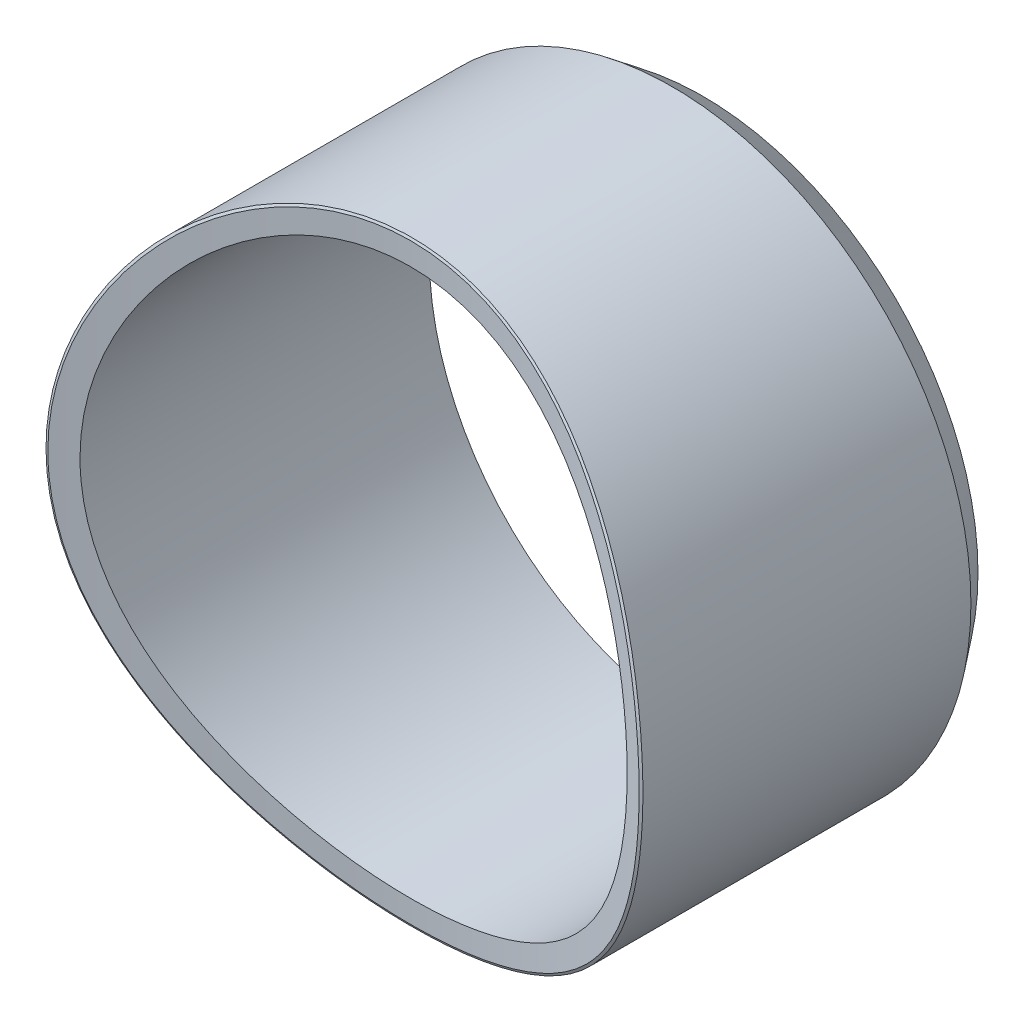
ISO-10303-21;
HEADER;
FILE_DESCRIPTION(('STEP AP214'),'2;1');
FILE_NAME('part.step','',(''),(''),'','','');
FILE_SCHEMA(('AUTOMOTIVE_DESIGN { 1 0 10303 214 1 1 1 1 }'));
ENDSEC;
DATA;
#1=APPLICATION_CONTEXT('core data for automotive mechanical design processes');
#2=APPLICATION_PROTOCOL_DEFINITION('international standard','automotive_design',2000,#1);
#3=PRODUCT_CONTEXT('',#1,'mechanical');
#4=PRODUCT('Part','Part','',(#3));
#5=PRODUCT_RELATED_PRODUCT_CATEGORY('part','',(#4));
#6=PRODUCT_DEFINITION_FORMATION('','',#4);
#7=PRODUCT_DEFINITION_CONTEXT('part definition',#1,'design');
#8=PRODUCT_DEFINITION('design','',#6,#7);
#9=PRODUCT_DEFINITION_SHAPE('','',#8);
#10=(LENGTH_UNIT() NAMED_UNIT(*) SI_UNIT(.MILLI.,.METRE.));
#11=(NAMED_UNIT(*) PLANE_ANGLE_UNIT() SI_UNIT($,.RADIAN.));
#12=(NAMED_UNIT(*) SI_UNIT($,.STERADIAN.) SOLID_ANGLE_UNIT());
#13=UNCERTAINTY_MEASURE_WITH_UNIT(LENGTH_MEASURE(1.E-05),#10,'distance_accuracy_value','');
#14=(GEOMETRIC_REPRESENTATION_CONTEXT(3) GLOBAL_UNCERTAINTY_ASSIGNED_CONTEXT((#13)) GLOBAL_UNIT_ASSIGNED_CONTEXT((#10,
#11,#12)) REPRESENTATION_CONTEXT('',''));
#15=CARTESIAN_POINT('',(0.,0.,0.));
#16=DIRECTION('',(0.,0.,1.));
#17=DIRECTION('',(1.,0.,0.));
#18=AXIS2_PLACEMENT_3D('',#15,#16,#17);
#19=CARTESIAN_POINT('',(0.,0.,0.));
#20=DIRECTION('',(0.,0.,1.));
#21=DIRECTION('',(1.,0.,0.));
#22=AXIS2_PLACEMENT_3D('',#19,#20,#21);
#23=PLANE('',#22);
#24=CARTESIAN_POINT('',(0.,0.,0.));
#25=DIRECTION('',(0.,0.,1.));
#26=DIRECTION('',(1.,0.,0.));
#27=AXIS2_PLACEMENT_3D('',#24,#25,#26);
#28=CIRCLE('',#27,280.9875);
#29=CARTESIAN_POINT('',(280.9875,0.,0.));
#30=VERTEX_POINT('',#29);
#31=EDGE_CURVE('E59',#30,#30,#28,.T.);
#32=ORIENTED_EDGE('',*,*,#31,.F.);
#33=EDGE_LOOP('',(#32));
#34=FACE_BOUND('',#33,.T.);
#35=CARTESIAN_POINT('',(0.,0.,0.));
#36=DIRECTION('',(0.,0.,1.));
#37=DIRECTION('',(1.,0.,0.));
#38=AXIS2_PLACEMENT_3D('',#35,#36,#37);
#39=CIRCLE('',#38,279.4);
#40=CARTESIAN_POINT('',(279.4,0.,0.));
#41=VERTEX_POINT('',#40);
#42=EDGE_CURVE('E49',#41,#41,#39,.T.);
#43=ORIENTED_EDGE('',*,*,#42,.T.);
#44=EDGE_LOOP('',(#43));
#45=FACE_BOUND('',#44,.T.);
#46=ADVANCED_FACE('F32',(#34,#45),#23,.F.);
#47=CARTESIAN_POINT('',(0.,0.,635.));
#48=DIRECTION('',(0.,0.,-1.));
#49=DIRECTION('',(-1.,0.,0.));
#50=AXIS2_PLACEMENT_3D('',#47,#48,#49);
#51=CYLINDRICAL_SURFACE('',#50,304.8);
#52=CARTESIAN_POINT('',(-304.8,0.,366.084110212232));
#53=CARTESIAN_POINT('',(-304.800157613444,-2.42718285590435,366.084185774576));
#54=CARTESIAN_POINT('',(-304.770963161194,-4.85417822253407,366.070260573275));
#55=CARTESIAN_POINT('',(-304.65444068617,-9.71105093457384,366.01479907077));
#56=CARTESIAN_POINT('',(-304.567002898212,-12.1409250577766,365.973210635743));
#57=CARTESIAN_POINT('',(-304.219049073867,-19.4114041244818,365.80795006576));
#58=CARTESIAN_POINT('',(-303.872884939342,-24.2474771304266,365.643777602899));
#59=CARTESIAN_POINT('',(-303.181212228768,-31.464482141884,365.31668247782));
#60=CARTESIAN_POINT('',(-302.923052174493,-33.8561168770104,365.194713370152));
#61=CARTESIAN_POINT('',(-302.351354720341,-38.626960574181,364.925126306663));
#62=CARTESIAN_POINT('',(-302.037917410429,-41.0061841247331,364.777554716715));
#63=CARTESIAN_POINT('',(-301.015289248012,-48.1197159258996,364.297242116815));
#64=CARTESIAN_POINT('',(-300.222828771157,-52.839814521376,363.926449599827));
#65=CARTESIAN_POINT('',(-298.41946051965,-62.2232045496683,363.087640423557));
#66=CARTESIAN_POINT('',(-297.408811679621,-66.8865564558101,362.61973903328));
#67=CARTESIAN_POINT('',(-295.170600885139,-76.1584373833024,361.591433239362));
#68=CARTESIAN_POINT('',(-293.942710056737,-80.7668718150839,361.030888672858));
#69=CARTESIAN_POINT('',(-291.941143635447,-87.6303694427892,360.125177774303));
#70=CARTESIAN_POINT('',(-291.246309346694,-89.912991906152,359.81200173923));
#71=CARTESIAN_POINT('',(-289.801346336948,-94.4667179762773,359.163720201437));
#72=CARTESIAN_POINT('',(-289.051028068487,-96.7377508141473,358.828540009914));
#73=CARTESIAN_POINT('',(-286.715065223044,-103.539223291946,357.790276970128));
#74=CARTESIAN_POINT('',(-285.050208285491,-108.038174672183,357.057105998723));
#75=CARTESIAN_POINT('',(-281.51308925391,-116.946419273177,355.517536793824));
#76=CARTESIAN_POINT('',(-279.640607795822,-121.355611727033,354.711061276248));
#77=CARTESIAN_POINT('',(-275.708128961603,-130.04164408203,353.039601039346));
#78=CARTESIAN_POINT('',(-273.649469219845,-134.319171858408,352.175043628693));
#79=CARTESIAN_POINT('',(-269.347510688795,-142.749381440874,350.394402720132));
#80=CARTESIAN_POINT('',(-267.104896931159,-146.902454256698,349.47851408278));
#81=CARTESIAN_POINT('',(-262.437538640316,-155.08651502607,347.602426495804));
#82=CARTESIAN_POINT('',(-260.013057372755,-159.11766803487,346.642292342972));
#83=CARTESIAN_POINT('',(-254.98300553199,-167.05958400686,344.684631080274));
#84=CARTESIAN_POINT('',(-252.377324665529,-170.970271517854,343.68708136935));
#85=CARTESIAN_POINT('',(-246.984348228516,-178.672646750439,341.661192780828));
#86=CARTESIAN_POINT('',(-244.196578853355,-182.463982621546,340.632777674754));
#87=CARTESIAN_POINT('',(-238.437589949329,-189.92850894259,338.551583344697));
#88=CARTESIAN_POINT('',(-235.465545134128,-193.601036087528,337.498710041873));
#89=CARTESIAN_POINT('',(-229.342500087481,-200.817278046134,335.377881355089));
#90=CARTESIAN_POINT('',(-226.190802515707,-204.360388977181,334.309881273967));
#91=CARTESIAN_POINT('',(-221.348357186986,-209.555944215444,332.708497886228));
#92=CARTESIAN_POINT('',(-219.717919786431,-211.265146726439,332.175708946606));
#93=CARTESIAN_POINT('',(-216.420950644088,-214.640916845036,331.111991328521));
#94=CARTESIAN_POINT('',(-214.754510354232,-216.307573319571,330.581061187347));
#95=CARTESIAN_POINT('',(-209.706849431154,-221.241310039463,328.993720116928));
#96=CARTESIAN_POINT('',(-206.268696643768,-224.451362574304,327.939909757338));
#97=CARTESIAN_POINT('',(-199.251183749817,-230.704888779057,325.849566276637));
#98=CARTESIAN_POINT('',(-195.672094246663,-233.7486572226,324.813005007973));
#99=CARTESIAN_POINT('',(-188.37119510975,-239.67089584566,322.763025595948));
#100=CARTESIAN_POINT('',(-184.64934527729,-242.549318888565,321.749614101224));
#101=CARTESIAN_POINT('',(-178.962868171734,-246.740222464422,320.252481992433));
#102=CARTESIAN_POINT('',(-177.048499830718,-248.117131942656,319.75687684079));
#103=CARTESIAN_POINT('',(-173.183734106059,-250.83012964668,318.773636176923));
#104=CARTESIAN_POINT('',(-171.233279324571,-252.166141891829,318.286016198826));
#105=CARTESIAN_POINT('',(-167.295612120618,-254.796102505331,317.319772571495));
#106=CARTESIAN_POINT('',(-165.308328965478,-256.089953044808,316.841170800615));
#107=CARTESIAN_POINT('',(-161.296089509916,-258.635715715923,315.893529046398));
#108=CARTESIAN_POINT('',(-159.271037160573,-259.887488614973,315.424522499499));
#109=CARTESIAN_POINT('',(-153.143136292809,-263.577075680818,314.033910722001));
#110=CARTESIAN_POINT('',(-148.993770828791,-265.944999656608,313.130245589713));
#111=CARTESIAN_POINT('',(-140.601241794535,-270.475497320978,311.383273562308));
#112=CARTESIAN_POINT('',(-136.358683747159,-272.639082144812,310.539675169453));
#113=CARTESIAN_POINT('',(-127.782668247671,-276.761915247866,308.917381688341));
#114=CARTESIAN_POINT('',(-123.449595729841,-278.721875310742,308.138462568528));
#115=CARTESIAN_POINT('',(-114.691985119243,-282.438316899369,306.649866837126));
#116=CARTESIAN_POINT('',(-110.267569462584,-284.195052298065,305.940104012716));
#117=CARTESIAN_POINT('',(-101.327218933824,-287.504035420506,304.593985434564));
#118=CARTESIAN_POINT('',(-96.8112041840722,-289.056094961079,303.95769730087));
#119=CARTESIAN_POINT('',(-87.6857600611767,-291.954073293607,302.762833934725));
#120=CARTESIAN_POINT('',(-83.0760602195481,-293.299255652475,302.204536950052));
#121=CARTESIAN_POINT('',(-73.76284735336,-295.779337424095,301.170303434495));
#122=CARTESIAN_POINT('',(-69.0589498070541,-296.912996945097,300.694853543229));
#123=CARTESIAN_POINT('',(-59.6033333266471,-298.954594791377,299.835438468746));
#124=CARTESIAN_POINT('',(-54.851719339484,-299.862948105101,299.45130514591));
#125=CARTESIAN_POINT('',(-45.3345602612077,-301.44816372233,298.779002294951));
#126=CARTESIAN_POINT('',(-40.5692970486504,-302.126464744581,298.490236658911));
#127=CARTESIAN_POINT('',(-31.0219391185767,-303.255310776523,298.008827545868));
#128=CARTESIAN_POINT('',(-26.2399413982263,-303.706550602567,297.815890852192));
#129=CARTESIAN_POINT('',(-16.6596099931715,-304.382397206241,297.526635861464));
#130=CARTESIAN_POINT('',(-11.861286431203,-304.607125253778,297.430265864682));
#131=CARTESIAN_POINT('',(-2.24849989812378,-304.829814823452,297.334770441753));
#132=CARTESIAN_POINT('',(2.56597594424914,-304.82730739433,297.335846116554));
#133=CARTESIAN_POINT('',(12.211267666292,-304.593830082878,297.435963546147));
#134=CARTESIAN_POINT('',(17.0420524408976,-304.361774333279,297.535470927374));
#135=CARTESIAN_POINT('',(26.7130862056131,-303.666252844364,297.833124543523));
#136=CARTESIAN_POINT('',(31.553217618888,-303.20140486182,298.031859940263));
#137=CARTESIAN_POINT('',(41.175844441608,-302.044726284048,298.525044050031));
#138=CARTESIAN_POINT('',(45.9585085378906,-301.354084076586,298.818991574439));
#139=CARTESIAN_POINT('',(55.4514225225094,-299.752105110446,299.4982030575));
#140=CARTESIAN_POINT('',(60.1619317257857,-298.842074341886,299.882926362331));
#141=CARTESIAN_POINT('',(69.5122021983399,-296.806263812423,300.739678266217));
#142=CARTESIAN_POINT('',(74.1521410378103,-295.681180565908,301.211424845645));
#143=CARTESIAN_POINT('',(83.3623994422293,-293.217659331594,302.238495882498));
#144=CARTESIAN_POINT('',(87.9327609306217,-291.879355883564,302.793767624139));
#145=CARTESIAN_POINT('',(97.0057084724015,-288.990567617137,303.984577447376));
#146=CARTESIAN_POINT('',(101.508140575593,-287.439663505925,304.62027394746));
#147=CARTESIAN_POINT('',(108.201833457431,-284.957513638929,305.629824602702));
#148=CARTESIAN_POINT('',(110.42599695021,-284.102920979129,305.976175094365));
#149=CARTESIAN_POINT('',(114.85648637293,-282.341207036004,306.687361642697));
#150=CARTESIAN_POINT('',(117.06275945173,-281.433969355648,307.052238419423));
#151=CARTESIAN_POINT('',(123.669431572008,-278.625271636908,308.177002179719));
#152=CARTESIAN_POINT('',(128.032720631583,-276.646068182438,308.963251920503));
#153=CARTESIAN_POINT('',(134.499527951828,-273.529238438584,310.189176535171));
#154=CARTESIAN_POINT('',(136.643285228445,-272.464988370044,310.605822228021));
#155=CARTESIAN_POINT('',(140.895851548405,-270.290763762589,311.452589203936));
#156=CARTESIAN_POINT('',(143.004751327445,-269.180948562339,311.882662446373));
#157=CARTESIAN_POINT('',(147.186379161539,-266.917118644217,312.755143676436));
#158=CARTESIAN_POINT('',(149.259206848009,-265.763269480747,313.197504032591));
#159=CARTESIAN_POINT('',(153.371512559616,-263.41128459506,314.094018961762));
#160=CARTESIAN_POINT('',(155.411046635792,-262.213237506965,314.548149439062));
#161=CARTESIAN_POINT('',(161.475109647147,-258.555540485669,315.9261656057));
#162=CARTESIAN_POINT('',(165.454541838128,-256.027221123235,316.867652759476));
#163=CARTESIAN_POINT('',(173.279512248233,-250.797595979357,318.788602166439));
#164=CARTESIAN_POINT('',(177.125238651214,-248.096549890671,319.768006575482));
#165=CARTESIAN_POINT('',(184.685447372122,-242.521206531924,321.759053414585));
#166=CARTESIAN_POINT('',(188.399819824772,-239.646769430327,322.770721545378));
#167=CARTESIAN_POINT('',(195.698561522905,-233.724801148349,324.820443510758));
#168=CARTESIAN_POINT('',(199.282533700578,-230.676803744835,325.858563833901));
#169=CARTESIAN_POINT('',(206.320585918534,-224.404488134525,327.955382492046));
#170=CARTESIAN_POINT('',(209.773918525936,-221.179357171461,329.014158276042));
#171=CARTESIAN_POINT('',(216.537494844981,-214.562396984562,331.14221193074));
#172=CARTESIAN_POINT('',(219.847219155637,-211.170044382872,332.211513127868));
#173=CARTESIAN_POINT('',(226.289158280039,-204.251306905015,334.342986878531));
#174=CARTESIAN_POINT('',(229.42216556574,-200.725662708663,335.40516863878));
#175=CARTESIAN_POINT('',(235.5115815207,-193.544439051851,337.514983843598));
#176=CARTESIAN_POINT('',(238.468602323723,-189.889390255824,338.562656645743));
#177=CARTESIAN_POINT('',(244.208203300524,-182.448784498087,340.636983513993));
#178=CARTESIAN_POINT('',(246.991054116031,-178.663444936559,341.663668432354));
#179=CARTESIAN_POINT('',(252.383399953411,-170.961481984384,343.689383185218));
#180=CARTESIAN_POINT('',(254.99281981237,-167.04480276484,344.68840092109));
#181=CARTESIAN_POINT('',(260.03768166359,-159.077827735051,346.651944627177));
#182=CARTESIAN_POINT('',(262.472658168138,-155.027213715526,347.616375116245));
#183=CARTESIAN_POINT('',(267.168209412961,-146.787999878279,349.504174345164));
#184=CARTESIAN_POINT('',(269.427831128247,-142.598801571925,350.427308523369));
#185=CARTESIAN_POINT('',(272.67349989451,-136.226799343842,351.771315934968));
#186=CARTESIAN_POINT('',(273.732678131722,-134.085330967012,352.213069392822));
#187=CARTESIAN_POINT('',(275.800764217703,-129.778005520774,353.081237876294));
#188=CARTESIAN_POINT('',(276.809723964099,-127.612176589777,353.507668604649));
#189=CARTESIAN_POINT('',(278.774495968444,-123.261715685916,354.343200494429));
#190=CARTESIAN_POINT('',(279.73046606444,-121.077164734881,354.75235214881));
#191=CARTESIAN_POINT('',(281.587823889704,-116.692034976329,355.551909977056));
#192=CARTESIAN_POINT('',(282.489411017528,-114.491552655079,355.942383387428));
#193=CARTESIAN_POINT('',(285.114692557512,-107.864859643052,357.085481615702));
#194=CARTESIAN_POINT('',(286.763178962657,-103.403935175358,357.811607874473));
#195=CARTESIAN_POINT('',(289.850029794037,-94.4064740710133,359.183759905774));
#196=CARTESIAN_POINT('',(291.288739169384,-89.8700755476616,359.829916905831));
#197=CARTESIAN_POINT('',(293.955520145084,-80.720962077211,361.03672370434));
#198=CARTESIAN_POINT('',(295.18344316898,-76.1081957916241,361.597313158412));
#199=CARTESIAN_POINT('',(297.42679113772,-66.8072135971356,362.628030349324));
#200=CARTESIAN_POINT('',(298.441602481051,-62.1188205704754,363.097896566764));
#201=CARTESIAN_POINT('',(300.255432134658,-52.6604139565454,363.941661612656));
#202=CARTESIAN_POINT('',(301.053023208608,-47.8900696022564,364.314924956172));
#203=CARTESIAN_POINT('',(302.4247918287,-38.2858506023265,364.95931467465));
#204=CARTESIAN_POINT('',(302.997823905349,-33.4517769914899,365.229917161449));
#205=CARTESIAN_POINT('',(303.910338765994,-23.7715506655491,365.661538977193));
#206=CARTESIAN_POINT('',(304.250524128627,-18.9254789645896,365.822887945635));
#207=CARTESIAN_POINT('',(304.697566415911,-9.2530763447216,366.035227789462));
#208=CARTESIAN_POINT('',(304.805987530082,-4.42683391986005,366.086958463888));
#209=CARTESIAN_POINT('',(304.79352018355,5.20163902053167,366.081027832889));
#210=CARTESIAN_POINT('',(304.673753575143,10.0038712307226,366.023901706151));
#211=CARTESIAN_POINT('',(304.207954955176,19.5861770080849,365.802683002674));
#212=CARTESIAN_POINT('',(303.86232829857,24.366274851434,365.638782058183));
#213=CARTESIAN_POINT('',(302.946241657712,33.9049180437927,365.205564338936));
#214=CARTESIAN_POINT('',(302.375567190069,38.6634384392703,364.936147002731));
#215=CARTESIAN_POINT('',(301.351976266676,45.7769263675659,364.455393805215));
#216=CARTESIAN_POINT('',(300.982316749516,48.1468074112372,364.282122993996));
#217=CARTESIAN_POINT('',(300.186871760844,52.8802674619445,363.910263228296));
#218=CARTESIAN_POINT('',(299.760971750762,55.2438232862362,363.711622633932));
#219=CARTESIAN_POINT('',(298.852640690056,59.9654945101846,363.289152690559));
#220=CARTESIAN_POINT('',(298.370037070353,62.3235698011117,363.065246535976));
#221=CARTESIAN_POINT('',(297.346752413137,67.0354614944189,362.592063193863));
#222=CARTESIAN_POINT('',(296.805825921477,69.3892138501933,362.342679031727));
#223=CARTESIAN_POINT('',(295.668445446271,74.0843414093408,361.820244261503));
#224=CARTESIAN_POINT('',(295.071910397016,76.4256931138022,361.547159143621));
#225=CARTESIAN_POINT('',(293.825583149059,81.0870614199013,360.978901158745));
#226=CARTESIAN_POINT('',(293.175885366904,83.4071080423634,360.683767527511));
#227=CARTESIAN_POINT('',(291.824838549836,88.0178333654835,360.072697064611));
#228=CARTESIAN_POINT('',(291.123735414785,90.3085972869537,359.756859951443));
#229=CARTESIAN_POINT('',(289.671015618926,94.8637502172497,359.105455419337));
#230=CARTESIAN_POINT('',(288.919550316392,97.1281962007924,358.769947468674));
#231=CARTESIAN_POINT('',(286.591619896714,103.877764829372,357.735820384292));
#232=CARTESIAN_POINT('',(284.937825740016,108.332047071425,357.007874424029));
#233=CARTESIAN_POINT('',(281.432649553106,117.137374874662,355.482842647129));
#234=CARTESIAN_POINT('',(279.581740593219,121.488638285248,354.685923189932));
#235=CARTESIAN_POINT('',(275.684233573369,130.090950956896,353.029579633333));
#236=CARTESIAN_POINT('',(273.6376180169,134.341991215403,352.170149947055));
#237=CARTESIAN_POINT('',(269.349539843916,142.745364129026,350.395228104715));
#238=CARTESIAN_POINT('',(267.107638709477,146.897446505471,349.479611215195));
#239=CARTESIAN_POINT('',(262.427920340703,155.103748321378,347.598564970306));
#240=CARTESIAN_POINT('',(259.989269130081,159.15744502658,346.632930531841));
#241=CARTESIAN_POINT('',(254.915453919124,167.164104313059,344.658555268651));
#242=CARTESIAN_POINT('',(252.279214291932,171.116330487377,343.64959352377));
#243=CARTESIAN_POINT('',(246.837469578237,178.877076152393,341.606539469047));
#244=CARTESIAN_POINT('',(244.032501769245,182.685994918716,340.572532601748));
#245=CARTESIAN_POINT('',(238.262175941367,190.150509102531,338.489181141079));
#246=CARTESIAN_POINT('',(235.297502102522,193.806655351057,337.439914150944));
#247=CARTESIAN_POINT('',(229.211457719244,200.966233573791,335.333652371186));
#248=CARTESIAN_POINT('',(226.090529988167,204.470049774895,334.276685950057));
#249=CARTESIAN_POINT('',(221.293144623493,209.612745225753,332.690735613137));
#250=CARTESIAN_POINT('',(219.675669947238,211.307174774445,332.162313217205));
#251=CARTESIAN_POINT('',(216.402688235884,214.658454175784,331.106280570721));
#252=CARTESIAN_POINT('',(214.747188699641,216.315311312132,330.578670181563));
#253=CARTESIAN_POINT('',(209.715574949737,221.235324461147,328.996033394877));
#254=CARTESIAN_POINT('',(206.281359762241,224.440394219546,327.943528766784));
#255=CARTESIAN_POINT('',(201.015498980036,229.131870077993,326.374965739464));
#256=CARTESIAN_POINT('',(199.238627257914,230.678364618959,325.853107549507));
#257=CARTESIAN_POINT('',(195.645326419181,233.733726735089,324.81322174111));
#258=CARTESIAN_POINT('',(193.828825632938,235.242513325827,324.295203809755));
#259=CARTESIAN_POINT('',(188.309587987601,239.718915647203,322.745610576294));
#260=CARTESIAN_POINT('',(184.552319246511,242.62301536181,321.723041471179));
#261=CARTESIAN_POINT('',(178.816393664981,246.847026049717,320.213936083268));
#262=CARTESIAN_POINT('',(176.888660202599,248.232397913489,319.715249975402));
#263=CARTESIAN_POINT('',(173.004575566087,250.95473435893,318.728307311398));
#264=CARTESIAN_POINT('',(171.048314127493,252.291817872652,318.240026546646));
#265=CARTESIAN_POINT('',(167.107635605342,254.918617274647,317.274500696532));
#266=CARTESIAN_POINT('',(165.123284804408,256.208425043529,316.797234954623));
#267=CARTESIAN_POINT('',(161.127315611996,258.740436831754,315.854541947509));
#268=CARTESIAN_POINT('',(159.115757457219,259.982728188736,315.389093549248));
#269=CARTESIAN_POINT('',(153.04253421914,263.636292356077,314.012097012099));
#270=CARTESIAN_POINT('',(148.935275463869,265.978954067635,313.1181661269));
#271=CARTESIAN_POINT('',(140.607827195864,270.473499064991,311.385027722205));
#272=CARTESIAN_POINT('',(136.38766826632,272.625433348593,310.545805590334));
#273=CARTESIAN_POINT('',(129.975820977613,275.708326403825,309.332460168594));
#274=CARTESIAN_POINT('',(127.823370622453,276.712454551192,308.93532565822));
#275=CARTESIAN_POINT('',(123.48945975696,278.673202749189,308.156506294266));
#276=CARTESIAN_POINT('',(121.307955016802,279.629736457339,307.774849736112));
#277=CARTESIAN_POINT('',(116.916102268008,281.494820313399,307.027770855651));
#278=CARTESIAN_POINT('',(114.705702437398,282.403263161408,306.662385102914));
#279=CARTESIAN_POINT('',(110.255262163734,284.170544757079,305.948828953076));
#280=CARTESIAN_POINT('',(108.015156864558,285.029240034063,305.600708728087));
#281=CARTESIAN_POINT('',(101.249684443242,287.531824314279,304.582574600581));
#282=CARTESIAN_POINT('',(96.6907092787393,289.097309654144,303.940755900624));
#283=CARTESIAN_POINT('',(87.519505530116,292.004239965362,302.742094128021));
#284=CARTESIAN_POINT('',(82.9077161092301,293.346886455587,302.184796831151));
#285=CARTESIAN_POINT('',(73.6366932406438,295.809847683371,301.157568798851));
#286=CARTESIAN_POINT('',(68.9777449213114,296.931083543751,300.687276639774));
#287=CARTESIAN_POINT('',(59.6125825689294,298.952053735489,299.83649853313));
#288=CARTESIAN_POINT('',(54.9064664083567,299.852175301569,299.455855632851));
#289=CARTESIAN_POINT('',(45.4471397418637,301.430878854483,298.786351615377));
#290=CARTESIAN_POINT('',(40.6938970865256,302.109297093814,298.497558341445));
#291=CARTESIAN_POINT('',(31.1405798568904,303.243191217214,298.013996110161));
#292=CARTESIAN_POINT('',(26.3404038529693,303.697943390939,297.819532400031));
#293=CARTESIAN_POINT('',(16.6914016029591,304.381304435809,297.527044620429));
#294=CARTESIAN_POINT('',(11.8424575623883,304.608508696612,297.42961957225));
#295=CARTESIAN_POINT('',(2.1376178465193,304.831097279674,297.334194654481));
#296=CARTESIAN_POINT('',(-2.71827868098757,304.826450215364,297.336208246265));
#297=CARTESIAN_POINT('',(-12.3880995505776,304.586285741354,297.439205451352));
#298=CARTESIAN_POINT('',(-17.202073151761,304.352440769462,297.539472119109));
#299=CARTESIAN_POINT('',(-26.7908306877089,303.65836612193,297.836492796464));
#300=CARTESIAN_POINT('',(-31.5656943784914,303.199067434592,298.032849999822));
#301=CARTESIAN_POINT('',(-41.0770202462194,302.057428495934,298.519634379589));
#302=CARTESIAN_POINT('',(-45.8135269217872,301.375402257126,298.809929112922));
#303=CARTESIAN_POINT('',(-55.2477665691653,299.78948411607,299.482390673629));
#304=CARTESIAN_POINT('',(-59.9454537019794,298.88536043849,299.864653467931));
#305=CARTESIAN_POINT('',(-69.3010818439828,296.856004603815,300.7188043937));
#306=CARTESIAN_POINT('',(-73.9588384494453,295.730046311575,301.190986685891));
#307=CARTESIAN_POINT('',(-83.2401973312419,293.253349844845,302.22368897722));
#308=CARTESIAN_POINT('',(-87.8633187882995,291.901065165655,302.784815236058));
#309=CARTESIAN_POINT('',(-97.0358777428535,288.981570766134,303.988305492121));
#310=CARTESIAN_POINT('',(-101.585235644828,287.414144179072,304.630751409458));
#311=CARTESIAN_POINT('',(-108.333481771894,284.909270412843,305.649447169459));
#312=CARTESIAN_POINT('',(-110.566157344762,284.050440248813,305.997481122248));
#313=CARTESIAN_POINT('',(-114.999693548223,282.283941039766,306.710441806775));
#314=CARTESIAN_POINT('',(-117.200641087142,281.376463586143,307.07530157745));
#315=CARTESIAN_POINT('',(-121.573027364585,279.51394467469,307.821066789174));
#316=CARTESIAN_POINT('',(-123.744525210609,278.559025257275,308.201930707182));
#317=CARTESIAN_POINT('',(-128.059524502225,276.601596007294,308.979133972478));
#318=CARTESIAN_POINT('',(-130.203059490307,275.599151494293,309.375451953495));
#319=CARTESIAN_POINT('',(-136.59011235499,272.521246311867,310.58639046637));
#320=CARTESIAN_POINT('',(-140.794657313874,270.373263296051,311.423779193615));
#321=CARTESIAN_POINT('',(-149.09224074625,265.888178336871,313.152746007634));
#322=CARTESIAN_POINT('',(-153.185237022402,263.551006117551,314.044344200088));
#323=CARTESIAN_POINT('',(-159.237209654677,259.906950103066,315.417444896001));
#324=CARTESIAN_POINT('',(-161.241486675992,258.668187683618,315.881474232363));
#325=CARTESIAN_POINT('',(-165.222472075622,256.143925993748,316.821106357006));
#326=CARTESIAN_POINT('',(-167.199129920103,254.858353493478,317.296726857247));
#327=CARTESIAN_POINT('',(-171.125036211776,252.239776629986,318.259064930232));
#328=CARTESIAN_POINT('',(-173.074209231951,250.906667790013,318.745805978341));
#329=CARTESIAN_POINT('',(-176.944825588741,248.192281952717,319.729713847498));
#330=CARTESIAN_POINT('',(-178.866171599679,246.810875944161,320.226906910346));
#331=CARTESIAN_POINT('',(-184.59465853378,242.590686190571,321.734465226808));
#332=CARTESIAN_POINT('',(-188.350652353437,239.686340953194,322.756972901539));
#333=CARTESIAN_POINT('',(-195.706322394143,233.718892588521,324.822530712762));
#334=CARTESIAN_POINT('',(-199.306480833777,230.656354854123,325.865500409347));
#335=CARTESIAN_POINT('',(-206.341734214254,224.384181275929,327.961966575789));
#336=CARTESIAN_POINT('',(-209.777517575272,221.175293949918,329.015391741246));
#337=CARTESIAN_POINT('',(-216.488777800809,214.610541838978,331.126806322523));
#338=CARTESIAN_POINT('',(-219.764588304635,211.255013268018,332.184780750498));
#339=CARTESIAN_POINT('',(-226.157263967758,204.396750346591,334.29874795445));
#340=CARTESIAN_POINT('',(-229.274165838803,200.894050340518,335.354741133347));
#341=CARTESIAN_POINT('',(-235.349836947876,193.741085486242,337.458140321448));
#342=CARTESIAN_POINT('',(-238.308335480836,190.090585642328,338.505529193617));
#343=CARTESIAN_POINT('',(-244.066875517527,182.638637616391,340.58513898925));
#344=CARTESIAN_POINT('',(-246.866255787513,178.83665743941,341.617285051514));
#345=CARTESIAN_POINT('',(-252.302666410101,171.081840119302,343.658544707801));
#346=CARTESIAN_POINT('',(-254.938790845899,167.128329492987,344.667513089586));
#347=CARTESIAN_POINT('',(-260.019298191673,159.108341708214,346.64467792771));
#348=CARTESIAN_POINT('',(-262.464261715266,155.042261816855,347.612993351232));
#349=CARTESIAN_POINT('',(-267.155924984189,146.809821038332,349.499216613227));
#350=CARTESIAN_POINT('',(-269.403427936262,142.643963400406,350.417322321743));
#351=CARTESIAN_POINT('',(-273.702014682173,134.211241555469,352.197040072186));
#352=CARTESIAN_POINT('',(-275.753485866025,129.944598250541,353.058762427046));
#353=CARTESIAN_POINT('',(-279.659906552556,121.309214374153,354.719410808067));
#354=CARTESIAN_POINT('',(-281.514814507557,116.940452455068,355.518323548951));
#355=CARTESIAN_POINT('',(-285.026848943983,108.099694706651,357.04686839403));
#356=CARTESIAN_POINT('',(-286.683498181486,103.62747951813,357.776332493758));
#357=CARTESIAN_POINT('',(-289.014845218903,96.8469608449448,358.812387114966));
#358=CARTESIAN_POINT('',(-289.767800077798,94.5698107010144,359.148704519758));
#359=CARTESIAN_POINT('',(-291.223211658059,89.9880224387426,359.801600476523));
#360=CARTESIAN_POINT('',(-291.925489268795,87.6833174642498,360.1181085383));
#361=CARTESIAN_POINT('',(-293.948894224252,80.7479369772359,361.033664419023));
#362=CARTESIAN_POINT('',(-295.189062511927,76.0888235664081,361.599845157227));
#363=CARTESIAN_POINT('',(-296.882364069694,69.0620850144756,362.377912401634));
#364=CARTESIAN_POINT('',(-297.418143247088,66.7178223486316,362.62501299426));
#365=CARTESIAN_POINT('',(-298.432512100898,62.0230255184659,363.094206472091));
#366=CARTESIAN_POINT('',(-298.91129341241,59.6725411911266,363.316383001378));
#367=CARTESIAN_POINT('',(-300.26267088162,52.6134295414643,363.945047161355));
#368=CARTESIAN_POINT('',(-301.05311098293,47.8854730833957,364.314965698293));
#369=CARTESIAN_POINT('',(-302.409962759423,38.3957377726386,364.952338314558));
#370=CARTESIAN_POINT('',(-302.976596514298,33.6339972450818,365.21989395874));
#371=CARTESIAN_POINT('',(-303.885466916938,24.0773375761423,365.64975296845));
#372=CARTESIAN_POINT('',(-304.227387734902,19.2823812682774,365.811908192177));
#373=CARTESIAN_POINT('',(-304.570107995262,12.0734508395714,365.974683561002));
#374=CARTESIAN_POINT('',(-304.655988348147,9.66408696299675,366.015533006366));
#375=CARTESIAN_POINT('',(-304.770894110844,4.83652350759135,366.070228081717));
#376=CARTESIAN_POINT('',(-304.799749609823,2.41831896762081,366.083993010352));
#377=CARTESIAN_POINT('',(-304.8,0.,366.084110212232));
#378=B_SPLINE_CURVE_WITH_KNOTS('',3,(#52,#53,#54,#55,#56,#57,#58,#59,#60,#61,#62,#63,#64,#65,
#66,#67,#68,#69,#70,#71,#72,#73,#74,#75,#76,#77,#78,#79,#80,#81,#82,#83,#84,#85,#86,#87,#88,#89,
#90,#91,#92,#93,#94,#95,#96,#97,#98,#99,#100,#101,#102,#103,#104,#105,#106,#107,#108,#109,#110,
#111,#112,#113,#114,#115,#116,#117,#118,#119,#120,#121,#122,#123,#124,#125,#126,#127,#128,#129,
#130,#131,#132,#133,#134,#135,#136,#137,#138,#139,#140,#141,#142,#143,#144,#145,#146,#147,#148,
#149,#150,#151,#152,#153,#154,#155,#156,#157,#158,#159,#160,#161,#162,#163,#164,#165,#166,#167,
#168,#169,#170,#171,#172,#173,#174,#175,#176,#177,#178,#179,#180,#181,#182,#183,#184,#185,#186,
#187,#188,#189,#190,#191,#192,#193,#194,#195,#196,#197,#198,#199,#200,#201,#202,#203,#204,#205,
#206,#207,#208,#209,#210,#211,#212,#213,#214,#215,#216,#217,#218,#219,#220,#221,#222,#223,#224,
#225,#226,#227,#228,#229,#230,#231,#232,#233,#234,#235,#236,#237,#238,#239,#240,#241,#242,#243,
#244,#245,#246,#247,#248,#249,#250,#251,#252,#253,#254,#255,#256,#257,#258,#259,#260,#261,#262,
#263,#264,#265,#266,#267,#268,#269,#270,#271,#272,#273,#274,#275,#276,#277,#278,#279,#280,#281,
#282,#283,#284,#285,#286,#287,#288,#289,#290,#291,#292,#293,#294,#295,#296,#297,#298,#299,#300,
#301,#302,#303,#304,#305,#306,#307,#308,#309,#310,#311,#312,#313,#314,#315,#316,#317,#318,#319,
#320,#321,#322,#323,#324,#325,#326,#327,#328,#329,#330,#331,#332,#333,#334,#335,#336,#337,#338,
#339,#340,#341,#342,#343,#344,#345,#346,#347,#348,#349,#350,#351,#352,#353,#354,#355,#356,#357,
#358,#359,#360,#361,#362,#363,#364,#365,#366,#367,#368,#369,#370,#371,#372,#373,#374,#375,#376,
#377),.UNSPECIFIED.,.F.,.F.,(4,2,2,2,2,2,2,2,2,2,2,2,2,2,2,2,2,2,2,2,2,2,2,2,2,2,2,2,2,2,2,2,2,
2,2,2,2,2,2,2,2,2,2,2,2,2,2,2,2,2,2,2,2,2,2,2,2,2,2,2,2,2,2,2,2,2,2,2,2,2,2,2,2,2,2,2,2,2,2,2,2,
2,2,2,2,2,2,2,2,2,2,2,2,2,2,2,2,2,2,2,2,2,2,2,2,2,2,2,2,2,2,2,2,2,2,2,2,2,2,2,2,2,2,2,2,2,2,2,2,
2,2,2,2,2,2,2,2,2,2,2,2,2,2,2,2,2,2,2,2,2,2,2,2,2,2,2,2,2,2,2,2,2,4),(0.,7.2809632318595,
14.5756871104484,29.1213522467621,36.3465471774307,43.558791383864,57.9533604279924,
72.330939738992,86.7304738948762,93.9493356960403,101.194112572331,115.746169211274,
130.313749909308,144.783918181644,159.202454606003,173.600507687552,188.007402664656,
202.453406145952,216.969576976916,231.546541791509,238.810436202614,246.057655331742,
260.513398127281,274.942623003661,289.375941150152,296.604315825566,303.845391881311,
311.102220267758,318.381077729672,332.961699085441,347.46590851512,361.917579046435,
376.350996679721,390.797593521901,405.294482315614,419.873847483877,434.426156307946,
448.885702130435,463.300727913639,477.708032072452,492.145069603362,506.650729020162,
521.243558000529,535.760787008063,550.193642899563,564.580522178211,578.958359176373,
593.364971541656,600.587561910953,607.826779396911,622.385782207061,629.673431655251,
636.937466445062,644.176460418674,651.401652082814,665.819311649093,680.215782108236,
694.624022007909,709.07298100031,723.594913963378,738.165608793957,752.66469202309,
767.109976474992,781.532226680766,795.960687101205,810.426315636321,824.96573646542,
832.253921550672,839.534411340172,846.791899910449,854.020919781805,868.447355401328,
882.849794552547,897.262344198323,911.715838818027,926.262126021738,940.881676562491,
955.456918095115,969.933475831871,984.339045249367,998.718831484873,1013.11235572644,
1020.32607114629,1027.55471126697,1034.80595011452,1042.08899430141,1049.38282682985,
1056.66397559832,1063.91231958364,1071.13977982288,1085.55399246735,1099.93435938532,
1114.31601313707,1128.7308374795,1143.21034419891,1157.77537418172,1172.29625638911,
1186.7592346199,1201.18332029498,1208.38688831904,1215.58904772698,1230.02498615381,
1237.26267096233,1244.514755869,1259.08148479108,1266.35813998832,1273.61544442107,
1280.85780273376,1288.08613795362,1302.51690399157,1316.94379973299,1324.16757302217,
1331.40400605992,1338.65595765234,1345.92787725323,1360.50977359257,1375.01029467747,
1389.44915661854,1403.86254874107,1418.28656249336,1432.75694554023,1447.31611095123,
1461.87724729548,1476.3329173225,1490.72939001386,1505.10565283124,1519.49698257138,
1533.93622671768,1548.4784963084,1563.03553390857,1570.28696121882,1577.5116725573,
1584.7186748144,1591.91604358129,1606.29568067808,1620.68068394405,1627.88451095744,
1635.10013759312,1642.33274038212,1649.5864134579,1664.15112424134,1678.66696479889,
1693.11544794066,1707.53238373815,1721.94597363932,1736.38345724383,1750.87710803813,
1765.44506504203,1779.96690128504,1794.4266311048,1808.85716816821,1823.29074936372,
1837.75840419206,1845.02335238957,1852.3128332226,1866.86882541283,1874.12030673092,
1881.34667439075,1895.76323081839,1910.16544575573,1924.58785969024,1931.82086596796,
1939.07539135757),.UNSPECIFIED.);
#379=CARTESIAN_POINT('',(-304.8,0.,366.084110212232));
#380=VERTEX_POINT('',#379);
#381=EDGE_CURVE('E44',#380,#380,#378,.F.);
#382=ORIENTED_EDGE('',*,*,#381,.T.);
#383=EDGE_LOOP('',(#382));
#384=FACE_BOUND('',#383,.T.);
#385=CARTESIAN_POINT('',(0.,0.,31.0330541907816));
#386=DIRECTION('',(0.,0.,1.));
#387=DIRECTION('',(1.,0.,0.));
#388=AXIS2_PLACEMENT_3D('',#385,#386,#387);
#389=CIRCLE('',#388,304.8);
#390=CARTESIAN_POINT('',(304.8,0.,31.0330541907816));
#391=VERTEX_POINT('',#390);
#392=EDGE_CURVE('E119',#391,#391,#389,.T.);
#393=ORIENTED_EDGE('',*,*,#392,.T.);
#394=EDGE_LOOP('',(#393));
#395=FACE_BOUND('',#394,.T.);
#396=ADVANCED_FACE('F103',(#384,#395),#51,.T.);
#397=CARTESIAN_POINT('',(0.,0.,635.));
#398=DIRECTION('',(0.,0.,-1.));
#399=DIRECTION('',(-1.,0.,0.));
#400=AXIS2_PLACEMENT_3D('',#397,#398,#399);
#401=CYLINDRICAL_SURFACE('',#400,279.4);
#402=CARTESIAN_POINT('',(-279.4,0.,356.764175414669));
#403=CARTESIAN_POINT('',(-279.399995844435,3.74336190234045,356.76417138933));
#404=CARTESIAN_POINT('',(-279.324744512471,7.48702242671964,356.731314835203));
#405=CARTESIAN_POINT('',(-279.023919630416,14.9675817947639,356.600151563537));
#406=CARTESIAN_POINT('',(-278.798322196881,18.7044794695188,356.501834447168));
#407=CARTESIAN_POINT('',(-278.197258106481,26.1660400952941,356.240515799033));
#408=CARTESIAN_POINT('',(-277.821709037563,29.8906951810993,356.077478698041));
#409=CARTESIAN_POINT('',(-276.921805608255,37.3184779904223,355.688116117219));
#410=CARTESIAN_POINT('',(-276.397457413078,41.0216065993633,355.461793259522));
#411=CARTESIAN_POINT('',(-275.200006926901,48.40812786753,354.947171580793));
#412=CARTESIAN_POINT('',(-274.52656686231,52.0914559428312,354.658732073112));
#413=CARTESIAN_POINT('',(-273.03340333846,59.4232024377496,354.022578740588));
#414=CARTESIAN_POINT('',(-272.213678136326,63.0716204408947,353.67486420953));
#415=CARTESIAN_POINT('',(-270.430185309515,70.3265709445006,352.923058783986));
#416=CARTESIAN_POINT('',(-269.466440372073,73.9331099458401,352.518976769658));
#417=CARTESIAN_POINT('',(-267.397175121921,81.0988169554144,351.657619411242));
#418=CARTESIAN_POINT('',(-266.291655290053,84.6579851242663,351.200344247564));
#419=CARTESIAN_POINT('',(-263.945855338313,91.7098762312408,350.237980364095));
#420=CARTESIAN_POINT('',(-262.706099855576,95.202799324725,349.733078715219));
#421=CARTESIAN_POINT('',(-260.091162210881,102.130580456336,348.677815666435));
#422=CARTESIAN_POINT('',(-258.715980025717,105.565438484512,348.127454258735));
#423=CARTESIAN_POINT('',(-255.833010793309,112.372112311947,346.985289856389));
#424=CARTESIAN_POINT('',(-254.325220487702,115.743926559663,346.393485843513));
#425=CARTESIAN_POINT('',(-251.180018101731,122.419659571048,345.172665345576));
#426=CARTESIAN_POINT('',(-249.542605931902,125.723578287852,344.543648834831));
#427=CARTESIAN_POINT('',(-246.141796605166,132.257841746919,343.252996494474));
#428=CARTESIAN_POINT('',(-244.378444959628,135.488212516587,342.59137247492));
#429=CARTESIAN_POINT('',(-240.728149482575,141.872621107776,341.239701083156));
#430=CARTESIAN_POINT('',(-238.841195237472,145.026652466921,340.549651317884));
#431=CARTESIAN_POINT('',(-234.946973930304,151.253975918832,339.14573342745));
#432=CARTESIAN_POINT('',(-232.939710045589,154.327270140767,338.431865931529));
#433=CARTESIAN_POINT('',(-228.80792509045,160.389366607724,336.984868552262));
#434=CARTESIAN_POINT('',(-226.68340264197,163.378167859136,336.251738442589));
#435=CARTESIAN_POINT('',(-222.207031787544,169.420350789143,334.732394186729));
#436=CARTESIAN_POINT('',(-219.849107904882,172.469037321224,333.945399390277));
#437=CARTESIAN_POINT('',(-215.010635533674,178.464636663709,332.360534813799));
#438=CARTESIAN_POINT('',(-212.530085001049,181.411547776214,331.562664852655));
#439=CARTESIAN_POINT('',(-207.450163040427,187.199400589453,329.961415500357));
#440=CARTESIAN_POINT('',(-204.85079510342,190.040345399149,329.158036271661));
#441=CARTESIAN_POINT('',(-199.536652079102,195.61264961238,327.550955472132));
#442=CARTESIAN_POINT('',(-196.821865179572,198.343997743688,326.747253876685));
#443=CARTESIAN_POINT('',(-191.280014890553,203.693774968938,325.144575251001));
#444=CARTESIAN_POINT('',(-188.452913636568,206.312165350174,324.345599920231));
#445=CARTESIAN_POINT('',(-182.691540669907,211.430858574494,322.75790690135));
#446=CARTESIAN_POINT('',(-179.757280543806,213.931174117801,321.96918811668));
#447=CARTESIAN_POINT('',(-173.785005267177,218.810425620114,320.406911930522));
#448=CARTESIAN_POINT('',(-170.746978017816,221.189347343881,319.633356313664));
#449=CARTESIAN_POINT('',(-164.571995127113,225.821420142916,318.106554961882));
#450=CARTESIAN_POINT('',(-161.435048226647,228.074582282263,317.353307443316));
#451=CARTESIAN_POINT('',(-154.940248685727,232.538199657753,315.842577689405));
#452=CARTESIAN_POINT('',(-151.578567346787,234.743430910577,315.086108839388));
#453=CARTESIAN_POINT('',(-144.757967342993,239.009772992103,313.6056073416));
#454=CARTESIAN_POINT('',(-141.299047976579,241.070882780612,312.88157492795));
#455=CARTESIAN_POINT('',(-134.289362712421,245.044811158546,311.471044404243));
#456=CARTESIAN_POINT('',(-130.738593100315,246.957623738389,310.784547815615));
#457=CARTESIAN_POINT('',(-123.55121358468,250.63069426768,309.454033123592));
#458=CARTESIAN_POINT('',(-119.914603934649,252.390952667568,308.810014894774));
#459=CARTESIAN_POINT('',(-112.562890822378,255.754355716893,307.569308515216));
#460=CARTESIAN_POINT('',(-108.847811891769,257.357548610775,306.972605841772));
#461=CARTESIAN_POINT('',(-101.34466660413,260.403556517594,305.830684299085));
#462=CARTESIAN_POINT('',(-97.5566000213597,261.846371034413,305.285465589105));
#463=CARTESIAN_POINT('',(-89.9146875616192,264.567873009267,304.250595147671));
#464=CARTESIAN_POINT('',(-86.060844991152,265.846568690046,303.760940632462));
#465=CARTESIAN_POINT('',(-78.2946150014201,268.236498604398,302.840864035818));
#466=CARTESIAN_POINT('',(-74.3822282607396,269.347734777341,302.410441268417));
#467=CARTESIAN_POINT('',(-66.6973550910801,271.349990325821,301.631440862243));
#468=CARTESIAN_POINT('',(-62.9272652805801,272.249066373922,301.279909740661));
#469=CARTESIAN_POINT('',(-55.3481228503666,273.890451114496,300.635919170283));
#470=CARTESIAN_POINT('',(-51.5390706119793,274.632761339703,300.343459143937));
#471=CARTESIAN_POINT('',(-43.8893300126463,275.958611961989,299.819686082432));
#472=CARTESIAN_POINT('',(-40.0486422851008,276.542155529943,299.588371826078));
#473=CARTESIAN_POINT('',(-32.3430395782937,277.548887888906,299.188535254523));
#474=CARTESIAN_POINT('',(-28.4781245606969,277.972076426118,299.020013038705));
#475=CARTESIAN_POINT('',(-20.7329784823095,278.656801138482,298.747017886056));
#476=CARTESIAN_POINT('',(-16.8527526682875,278.918388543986,298.642524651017));
#477=CARTESIAN_POINT('',(-9.08354907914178,279.27937950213,298.498259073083));
#478=CARTESIAN_POINT('',(-5.19457128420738,279.378782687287,298.458486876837));
#479=CARTESIAN_POINT('',(2.58414220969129,279.415119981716,298.443952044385));
#480=CARTESIAN_POINT('',(6.47387788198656,279.352059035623,298.469187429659));
#481=CARTESIAN_POINT('',(14.2463352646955,279.063657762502,298.584481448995));
#482=CARTESIAN_POINT('',(18.1290570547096,278.838319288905,298.674539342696));
#483=CARTESIAN_POINT('',(25.6615738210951,278.243244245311,298.91194710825));
#484=CARTESIAN_POINT('',(29.3121815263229,277.882346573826,299.055787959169));
#485=CARTESIAN_POINT('',(36.5937179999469,277.01751142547,299.399690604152));
#486=CARTESIAN_POINT('',(40.224646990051,276.513575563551,299.59975176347));
#487=CARTESIAN_POINT('',(47.4603424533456,275.363931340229,300.054809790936));
#488=CARTESIAN_POINT('',(51.0651100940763,274.718229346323,300.309804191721));
#489=CARTESIAN_POINT('',(58.2424895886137,273.286596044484,300.873121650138));
#490=CARTESIAN_POINT('',(61.8151013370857,272.500664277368,301.181444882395));
#491=CARTESIAN_POINT('',(68.9222828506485,270.790396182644,301.849497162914));
#492=CARTESIAN_POINT('',(72.4568515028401,269.866055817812,302.209227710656));
#493=CARTESIAN_POINT('',(79.4820828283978,267.881096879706,302.97785730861));
#494=CARTESIAN_POINT('',(82.9727455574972,266.82047847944,303.386756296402));
#495=CARTESIAN_POINT('',(89.9047304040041,264.565274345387,304.251227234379));
#496=CARTESIAN_POINT('',(93.3460514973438,263.370685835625,304.706800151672));
#497=CARTESIAN_POINT('',(100.174025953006,260.850087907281,305.661855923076));
#498=CARTESIAN_POINT('',(103.560679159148,259.524078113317,306.161338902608));
#499=CARTESIAN_POINT('',(110.324736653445,256.722444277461,307.209041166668));
#500=CARTESIAN_POINT('',(113.701238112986,255.244872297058,307.757879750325));
#501=CARTESIAN_POINT('',(120.387803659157,252.160055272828,308.894386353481));
#502=CARTESIAN_POINT('',(123.697867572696,250.552809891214,309.482054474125));
#503=CARTESIAN_POINT('',(130.246840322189,247.211718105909,310.692687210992));
#504=CARTESIAN_POINT('',(133.485749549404,245.477872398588,311.315651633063));
#505=CARTESIAN_POINT('',(139.887987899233,241.886713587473,312.593180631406));
#506=CARTESIAN_POINT('',(143.051317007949,240.029400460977,313.247745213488));
#507=CARTESIAN_POINT('',(149.299025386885,236.193989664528,314.584805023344));
#508=CARTESIAN_POINT('',(152.383383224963,234.215859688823,315.26730770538));
#509=CARTESIAN_POINT('',(158.468260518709,230.142510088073,316.656093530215));
#510=CARTESIAN_POINT('',(161.468780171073,228.04729073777,317.362376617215));
#511=CARTESIAN_POINT('',(167.382164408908,223.74303258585,318.794622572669));
#512=CARTESIAN_POINT('',(170.29502958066,221.533994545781,319.520585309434));
#513=CARTESIAN_POINT('',(176.029730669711,217.005171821,320.98805945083));
#514=CARTESIAN_POINT('',(178.851558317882,214.685377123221,321.72957225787));
#515=CARTESIAN_POINT('',(184.582628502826,209.782630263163,323.272867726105));
#516=CARTESIAN_POINT('',(187.48544458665,207.192400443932,324.075410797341));
#517=CARTESIAN_POINT('',(193.179346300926,201.894090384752,325.687945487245));
#518=CARTESIAN_POINT('',(195.970430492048,199.186008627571,326.497937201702));
#519=CARTESIAN_POINT('',(201.436967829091,193.655944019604,328.120031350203));
#520=CARTESIAN_POINT('',(204.112416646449,190.833956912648,328.932133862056));
#521=CARTESIAN_POINT('',(209.343665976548,185.080272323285,330.552987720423));
#522=CARTESIAN_POINT('',(211.899466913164,182.148575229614,331.3617390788));
#523=CARTESIAN_POINT('',(216.888425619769,176.178626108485,332.97068339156));
#524=CARTESIAN_POINT('',(219.321542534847,173.140339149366,333.770873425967));
#525=CARTESIAN_POINT('',(224.060410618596,166.962415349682,335.356903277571));
#526=CARTESIAN_POINT('',(226.366162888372,163.82277938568,336.142743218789));
#527=CARTESIAN_POINT('',(230.846696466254,157.446330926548,337.694606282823));
#528=CARTESIAN_POINT('',(233.021469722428,154.209512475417,338.460628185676));
#529=CARTESIAN_POINT('',(237.235945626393,147.643768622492,339.96722717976));
#530=CARTESIAN_POINT('',(239.275660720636,144.31485174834,340.707806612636));
#531=CARTESIAN_POINT('',(243.272524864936,137.473545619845,342.178748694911));
#532=CARTESIAN_POINT('',(245.225680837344,133.958630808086,342.908223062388));
#533=CARTESIAN_POINT('',(248.981427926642,126.841625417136,344.328724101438));
#534=CARTESIAN_POINT('',(250.78401824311,123.239534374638,345.019750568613));
#535=CARTESIAN_POINT('',(254.234740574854,115.953887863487,346.357676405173));
#536=CARTESIAN_POINT('',(255.882866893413,112.270329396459,347.004574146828));
#537=CARTESIAN_POINT('',(259.020725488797,104.828105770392,348.2487107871));
#538=CARTESIAN_POINT('',(260.510458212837,101.069440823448,348.845949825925));
#539=CARTESIAN_POINT('',(263.327086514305,93.4856072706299,349.985238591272));
#540=CARTESIAN_POINT('',(264.654066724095,89.6604744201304,350.527316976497));
#541=CARTESIAN_POINT('',(267.142589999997,81.94883738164,351.551752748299));
#542=CARTESIAN_POINT('',(268.304132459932,78.0623329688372,352.034109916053));
#543=CARTESIAN_POINT('',(270.458454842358,70.2357267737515,352.934598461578));
#544=CARTESIAN_POINT('',(271.451245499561,66.2956284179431,353.352733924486));
#545=CARTESIAN_POINT('',(273.265221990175,58.369563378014,354.120832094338));
#546=CARTESIAN_POINT('',(274.086410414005,54.383597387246,354.470795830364));
#547=CARTESIAN_POINT('',(275.509801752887,46.618904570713,355.079950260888));
#548=CARTESIAN_POINT('',(276.122319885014,42.8423979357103,355.343381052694));
#549=CARTESIAN_POINT('',(277.19215417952,35.2635095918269,355.804853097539));
#550=CARTESIAN_POINT('',(277.649472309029,31.4611282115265,356.002895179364));
#551=CARTESIAN_POINT('',(278.407579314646,23.8380159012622,356.331829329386));
#552=CARTESIAN_POINT('',(278.708373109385,20.0172855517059,356.46272350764));
#553=CARTESIAN_POINT('',(279.152569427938,12.3649440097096,356.656198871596));
#554=CARTESIAN_POINT('',(279.295971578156,8.53333279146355,356.718779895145));
#555=CARTESIAN_POINT('',(279.424938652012,0.867968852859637,356.7750562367));
#556=CARTESIAN_POINT('',(279.410545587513,-2.96578302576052,356.768769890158));
#557=CARTESIAN_POINT('',(279.224066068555,-10.6287254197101,356.687412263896));
#558=CARTESIAN_POINT('',(279.051979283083,-14.4579159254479,356.612340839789));
#559=CARTESIAN_POINT('',(278.550630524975,-22.1039430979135,356.394092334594));
#560=CARTESIAN_POINT('',(278.221372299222,-25.9207800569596,356.250916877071));
#561=CARTESIAN_POINT('',(277.406648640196,-33.5346010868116,355.897741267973));
#562=CARTESIAN_POINT('',(276.921184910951,-37.3315853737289,355.687741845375));
#563=CARTESIAN_POINT('',(275.827591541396,-44.6823021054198,355.216626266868));
#564=CARTESIAN_POINT('',(275.2280466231,-48.2375469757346,354.959112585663));
#565=CARTESIAN_POINT('',(273.892818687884,-55.3178260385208,354.388329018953));
#566=CARTESIAN_POINT('',(273.157137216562,-58.8428605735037,354.07505976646));
#567=CARTESIAN_POINT('',(271.551440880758,-65.8567983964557,353.395165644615));
#568=CARTESIAN_POINT('',(270.681432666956,-69.3457034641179,353.028543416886));
#569=CARTESIAN_POINT('',(268.809062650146,-76.2820599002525,352.244665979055));
#570=CARTESIAN_POINT('',(267.806700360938,-79.7295111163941,351.827410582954));
#571=CARTESIAN_POINT('',(265.671679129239,-86.578211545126,350.945245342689));
#572=CARTESIAN_POINT('',(264.539000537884,-89.9794537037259,350.480328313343));
#573=CARTESIAN_POINT('',(262.145856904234,-96.7302164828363,349.506204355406));
#574=CARTESIAN_POINT('',(260.885392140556,-100.079737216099,348.996997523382));
#575=CARTESIAN_POINT('',(258.239151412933,-106.722458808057,347.937810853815));
#576=CARTESIAN_POINT('',(256.853371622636,-110.015657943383,347.387829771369));
#577=CARTESIAN_POINT('',(253.959140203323,-116.541217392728,346.250820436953));
#578=CARTESIAN_POINT('',(252.450686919,-119.773576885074,345.663791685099));
#579=CARTESIAN_POINT('',(249.250247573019,-126.302901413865,344.432090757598));
#580=CARTESIAN_POINT('',(247.553301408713,-129.597177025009,343.78604668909));
#581=CARTESIAN_POINT('',(244.03261225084,-136.110800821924,342.462512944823));
#582=CARTESIAN_POINT('',(242.208868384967,-139.330148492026,341.785023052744));
#583=CARTESIAN_POINT('',(238.437779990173,-145.689569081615,340.4031948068));
#584=CARTESIAN_POINT('',(236.490439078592,-148.829644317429,339.698857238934));
#585=CARTESIAN_POINT('',(232.475119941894,-155.026809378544,338.267898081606));
#586=CARTESIAN_POINT('',(230.40713268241,-158.083892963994,337.541274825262));
#587=CARTESIAN_POINT('',(226.153186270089,-164.1118785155,336.070243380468));
#588=CARTESIAN_POINT('',(223.96719151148,-167.082754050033,335.325829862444));
#589=CARTESIAN_POINT('',(219.481011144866,-172.933615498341,333.824121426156));
#590=CARTESIAN_POINT('',(217.180825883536,-175.813601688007,333.066826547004));
#591=CARTESIAN_POINT('',(212.469306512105,-181.479280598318,331.543978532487));
#592=CARTESIAN_POINT('',(210.057964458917,-184.264966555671,330.778424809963));
#593=CARTESIAN_POINT('',(205.127705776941,-189.738107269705,329.24382245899));
#594=CARTESIAN_POINT('',(202.60879584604,-192.425568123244,328.474774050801));
#595=CARTESIAN_POINT('',(197.276237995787,-197.894139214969,326.880867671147));
#596=CARTESIAN_POINT('',(194.45457316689,-200.667462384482,326.056091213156));
#597=CARTESIAN_POINT('',(188.694937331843,-206.092777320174,324.413429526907));
#598=CARTESIAN_POINT('',(185.756964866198,-208.744767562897,323.595544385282));
#599=CARTESIAN_POINT('',(179.768872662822,-213.923307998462,321.972203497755));
#600=CARTESIAN_POINT('',(176.718747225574,-216.449851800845,321.166748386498));
#601=CARTESIAN_POINT('',(170.510966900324,-221.373132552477,319.573791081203));
#602=CARTESIAN_POINT('',(167.35331282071,-223.769870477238,318.786288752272));
#603=CARTESIAN_POINT('',(160.934828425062,-228.429572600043,317.234520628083));
#604=CARTESIAN_POINT('',(157.67398960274,-230.692525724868,316.47025675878));
#605=CARTESIAN_POINT('',(151.054254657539,-235.08028498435,314.970249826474));
#606=CARTESIAN_POINT('',(147.695358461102,-237.205091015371,314.234506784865));
#607=CARTESIAN_POINT('',(140.884702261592,-241.312399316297,312.796608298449));
#608=CARTESIAN_POINT('',(137.432943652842,-243.294903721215,312.094452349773));
#609=CARTESIAN_POINT('',(130.441957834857,-247.113576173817,310.728585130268));
#610=CARTESIAN_POINT('',(126.902730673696,-248.949744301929,310.064873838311));
#611=CARTESIAN_POINT('',(119.743124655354,-252.47149781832,308.78064649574));
#612=CARTESIAN_POINT('',(116.122758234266,-254.157106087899,308.160123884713));
#613=CARTESIAN_POINT('',(108.806479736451,-257.374200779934,306.96656700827));
#614=CARTESIAN_POINT('',(105.110567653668,-258.905687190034,306.393532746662));
#615=CARTESIAN_POINT('',(97.64962735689,-261.810879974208,305.299064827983));
#616=CARTESIAN_POINT('',(93.8845978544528,-263.184583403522,304.777632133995));
#617=CARTESIAN_POINT('',(86.2923728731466,-265.770706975,303.790184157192));
#618=CARTESIAN_POINT('',(82.4651774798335,-266.98312733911,303.324168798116));
#619=CARTESIAN_POINT('',(74.7575666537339,-269.242989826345,302.451193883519));
#620=CARTESIAN_POINT('',(70.8771753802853,-270.290504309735,302.044208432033));
#621=CARTESIAN_POINT('',(63.0691120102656,-272.218327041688,301.292095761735));
#622=CARTESIAN_POINT('',(59.1414397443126,-273.098634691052,300.946968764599));
#623=CARTESIAN_POINT('',(51.2469891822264,-274.689494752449,300.321208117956));
#624=CARTESIAN_POINT('',(47.280213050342,-275.400056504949,300.040570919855));
#625=CARTESIAN_POINT('',(39.3156017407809,-276.649402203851,299.545918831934));
#626=CARTESIAN_POINT('',(35.3177670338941,-277.18818874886,299.331902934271));
#627=CARTESIAN_POINT('',(27.5613636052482,-278.062857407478,298.98388841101));
#628=CARTESIAN_POINT('',(23.804218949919,-278.409692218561,298.845577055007));
#629=CARTESIAN_POINT('',(16.2772585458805,-278.950976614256,298.6295323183));
#630=CARTESIAN_POINT('',(12.5074429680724,-279.145428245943,298.551798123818));
#631=CARTESIAN_POINT('',(4.96241846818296,-279.381423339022,298.457438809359));
#632=CARTESIAN_POINT('',(1.18720976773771,-279.422972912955,298.440811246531));
#633=CARTESIAN_POINT('',(-6.36157652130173,-279.353069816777,298.46877148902));
#634=CARTESIAN_POINT('',(-10.1351541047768,-279.241616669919,298.51335948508));
#635=CARTESIAN_POINT('',(-17.6729458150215,-278.866033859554,298.663436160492));
#636=CARTESIAN_POINT('',(-21.437161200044,-278.601925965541,298.768916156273));
#637=CARTESIAN_POINT('',(-28.9496584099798,-277.921755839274,299.040052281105));
#638=CARTESIAN_POINT('',(-32.697940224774,-277.505693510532,299.205708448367));
#639=CARTESIAN_POINT('',(-40.171545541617,-276.5227155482,299.596073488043));
#640=CARTESIAN_POINT('',(-43.8968691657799,-275.955800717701,299.82078204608));
#641=CARTESIAN_POINT('',(-51.3177287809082,-274.672586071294,300.327740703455));
#642=CARTESIAN_POINT('',(-55.0132649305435,-273.956287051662,300.609990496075));
#643=CARTESIAN_POINT('',(-62.2545881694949,-272.400468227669,301.220591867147));
#644=CARTESIAN_POINT('',(-65.801480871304,-271.565425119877,301.5472550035));
#645=CARTESIAN_POINT('',(-72.8552136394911,-269.758656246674,302.250834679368));
#646=CARTESIAN_POINT('',(-76.3620539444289,-268.786931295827,302.627750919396));
#647=CARTESIAN_POINT('',(-83.3299716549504,-266.709004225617,303.429514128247));
#648=CARTESIAN_POINT('',(-86.7910505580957,-265.60280651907,303.854359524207));
#649=CARTESIAN_POINT('',(-93.6622092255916,-263.258291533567,304.749419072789));
#650=CARTESIAN_POINT('',(-97.0722888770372,-262.019973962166,305.219633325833));
#651=CARTESIAN_POINT('',(-103.836726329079,-259.413634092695,306.202675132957));
#652=CARTESIAN_POINT('',(-107.191077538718,-258.045596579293,306.715507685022));
#653=CARTESIAN_POINT('',(-113.838781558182,-255.182658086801,307.780707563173));
#654=CARTESIAN_POINT('',(-117.132134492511,-253.687757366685,308.333074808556));
#655=CARTESIAN_POINT('',(-123.653341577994,-250.573875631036,309.47413961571));
#656=CARTESIAN_POINT('',(-126.881193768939,-248.954890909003,310.062838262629));
#657=CARTESIAN_POINT('',(-133.26694541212,-245.595799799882,311.273157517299));
#658=CARTESIAN_POINT('',(-136.424844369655,-243.855692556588,311.894778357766));
#659=CARTESIAN_POINT('',(-142.804441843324,-240.177850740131,313.195510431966));
#660=CARTESIAN_POINT('',(-146.022795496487,-238.234781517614,313.875948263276));
#661=CARTESIAN_POINT('',(-152.37425556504,-234.223301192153,315.264659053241));
#662=CARTESIAN_POINT('',(-155.50736133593,-232.154889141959,315.972932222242));
#663=CARTESIAN_POINT('',(-161.683991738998,-227.896287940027,317.41295703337));
#664=CARTESIAN_POINT('',(-164.727518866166,-225.706102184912,318.144708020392));
#665=CARTESIAN_POINT('',(-170.721307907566,-221.207227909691,319.627316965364));
#666=CARTESIAN_POINT('',(-173.671561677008,-218.898529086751,320.378176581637));
#667=CARTESIAN_POINT('',(-179.475430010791,-214.16571818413,321.894581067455));
#668=CARTESIAN_POINT('',(-182.329018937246,-211.741575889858,322.660129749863));
#669=CARTESIAN_POINT('',(-187.935302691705,-206.781747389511,324.201143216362));
#670=CARTESIAN_POINT('',(-190.687987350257,-204.246049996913,324.976608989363));
#671=CARTESIAN_POINT('',(-196.08848889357,-199.066976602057,326.532629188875));
#672=CARTESIAN_POINT('',(-198.736308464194,-196.423603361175,327.313183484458));
#673=CARTESIAN_POINT('',(-203.923641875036,-191.032722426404,328.874603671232));
#674=CARTESIAN_POINT('',(-206.463155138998,-188.285214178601,329.655469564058));
#675=CARTESIAN_POINT('',(-211.584425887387,-182.51623370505,331.260942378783));
#676=CARTESIAN_POINT('',(-214.159042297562,-179.488336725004,332.08525992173));
#677=CARTESIAN_POINT('',(-219.178148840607,-173.323679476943,333.72292142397));
#678=CARTESIAN_POINT('',(-221.622638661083,-170.186918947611,334.536265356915));
#679=CARTESIAN_POINT('',(-226.37765603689,-163.808853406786,336.146165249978));
#680=CARTESIAN_POINT('',(-228.688172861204,-160.567540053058,336.942719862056));
#681=CARTESIAN_POINT('',(-233.171002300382,-153.985384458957,338.513082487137));
#682=CARTESIAN_POINT('',(-235.343316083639,-150.644543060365,339.286890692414));
#683=CARTESIAN_POINT('',(-239.546345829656,-143.867339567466,340.806118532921));
#684=CARTESIAN_POINT('',(-241.577023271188,-140.430951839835,341.551530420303));
#685=CARTESIAN_POINT('',(-245.491986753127,-133.469065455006,343.007880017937));
#686=CARTESIAN_POINT('',(-247.376286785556,-129.943575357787,343.718821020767));
#687=CARTESIAN_POINT('',(-250.994664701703,-122.808941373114,345.100570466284));
#688=CARTESIAN_POINT('',(-252.728753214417,-119.199803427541,345.771381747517));
#689=CARTESIAN_POINT('',(-256.042992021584,-111.903531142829,347.067393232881));
#690=CARTESIAN_POINT('',(-257.623145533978,-108.216398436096,347.692594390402));
#691=CARTESIAN_POINT('',(-260.49086645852,-101.104982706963,348.838186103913));
#692=CARTESIAN_POINT('',(-261.791966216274,-97.6868535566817,349.362946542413));
#693=CARTESIAN_POINT('',(-264.260871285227,-90.7961752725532,350.366503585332));
#694=CARTESIAN_POINT('',(-265.428679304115,-87.3236272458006,350.84530112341));
#695=CARTESIAN_POINT('',(-267.628579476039,-80.328986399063,351.753433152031));
#696=CARTESIAN_POINT('',(-268.660656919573,-76.8068882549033,352.182762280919));
#697=CARTESIAN_POINT('',(-270.586565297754,-69.7191276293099,352.988626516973));
#698=CARTESIAN_POINT('',(-271.480397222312,-66.1534654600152,353.365162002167));
#699=CARTESIAN_POINT('',(-273.125599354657,-58.9934425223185,354.061632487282));
#700=CARTESIAN_POINT('',(-273.877321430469,-55.3991762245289,354.381707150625));
#701=CARTESIAN_POINT('',(-275.239224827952,-48.1790967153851,354.96388815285));
#702=CARTESIAN_POINT('',(-275.849400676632,-44.553282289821,355.225992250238));
#703=CARTESIAN_POINT('',(-276.92631542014,-37.278543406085,355.689983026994));
#704=CARTESIAN_POINT('',(-277.39312858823,-33.6296319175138,355.891900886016));
#705=CARTESIAN_POINT('',(-278.182455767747,-26.3137586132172,356.234027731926));
#706=CARTESIAN_POINT('',(-278.504991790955,-22.6467996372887,356.374246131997));
#707=CARTESIAN_POINT('',(-278.862417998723,-17.3958509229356,356.529814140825));
#708=CARTESIAN_POINT('',(-278.95645694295,-15.816419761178,356.570774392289));
#709=CARTESIAN_POINT('',(-279.117688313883,-12.6561704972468,356.641032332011));
#710=CARTESIAN_POINT('',(-279.184885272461,-11.0753526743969,356.670331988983));
#711=CARTESIAN_POINT('',(-279.29242027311,-7.91251688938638,356.717231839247));
#712=CARTESIAN_POINT('',(-279.332756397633,-6.3304988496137,356.734831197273));
#713=CARTESIAN_POINT('',(-279.38654946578,-3.16567173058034,356.758304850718));
#714=CARTESIAN_POINT('',(-279.400001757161,-1.58286256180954,356.764177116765));
#715=CARTESIAN_POINT('',(-279.4,0.,356.764175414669));
#716=B_SPLINE_CURVE_WITH_KNOTS('',3,(#402,#403,#404,#405,#406,#407,#408,#409,#410,#411,#412,
#413,#414,#415,#416,#417,#418,#419,#420,#421,#422,#423,#424,#425,#426,#427,#428,#429,#430,#431,
#432,#433,#434,#435,#436,#437,#438,#439,#440,#441,#442,#443,#444,#445,#446,#447,#448,#449,#450,
#451,#452,#453,#454,#455,#456,#457,#458,#459,#460,#461,#462,#463,#464,#465,#466,#467,#468,#469,
#470,#471,#472,#473,#474,#475,#476,#477,#478,#479,#480,#481,#482,#483,#484,#485,#486,#487,#488,
#489,#490,#491,#492,#493,#494,#495,#496,#497,#498,#499,#500,#501,#502,#503,#504,#505,#506,#507,
#508,#509,#510,#511,#512,#513,#514,#515,#516,#517,#518,#519,#520,#521,#522,#523,#524,#525,#526,
#527,#528,#529,#530,#531,#532,#533,#534,#535,#536,#537,#538,#539,#540,#541,#542,#543,#544,#545,
#546,#547,#548,#549,#550,#551,#552,#553,#554,#555,#556,#557,#558,#559,#560,#561,#562,#563,#564,
#565,#566,#567,#568,#569,#570,#571,#572,#573,#574,#575,#576,#577,#578,#579,#580,#581,#582,#583,
#584,#585,#586,#587,#588,#589,#590,#591,#592,#593,#594,#595,#596,#597,#598,#599,#600,#601,#602,
#603,#604,#605,#606,#607,#608,#609,#610,#611,#612,#613,#614,#615,#616,#617,#618,#619,#620,#621,
#622,#623,#624,#625,#626,#627,#628,#629,#630,#631,#632,#633,#634,#635,#636,#637,#638,#639,#640,
#641,#642,#643,#644,#645,#646,#647,#648,#649,#650,#651,#652,#653,#654,#655,#656,#657,#658,#659,
#660,#661,#662,#663,#664,#665,#666,#667,#668,#669,#670,#671,#672,#673,#674,#675,#676,#677,#678,
#679,#680,#681,#682,#683,#684,#685,#686,#687,#688,#689,#690,#691,#692,#693,#694,#695,#696,#697,
#698,#699,#700,#701,#702,#703,#704,#705,#706,#707,#708,#709,#710,#711,#712,#713,#714,#715),
.UNSPECIFIED.,.T.,.F.,(4,2,2,2,2,2,2,2,2,2,2,2,2,2,2,2,2,2,2,2,2,2,2,2,2,2,2,2,2,2,2,2,2,2,2,2,
2,2,2,2,2,2,2,2,2,2,2,2,2,2,2,2,2,2,2,2,2,2,2,2,2,2,2,2,2,2,2,2,2,2,2,2,2,2,2,2,2,2,2,2,2,2,2,2,
2,2,2,2,2,2,2,2,2,2,2,2,2,2,2,2,2,2,2,2,2,2,2,2,2,2,2,2,2,2,2,2,2,2,2,2,2,2,2,2,2,2,2,2,2,2,2,2,
2,2,2,2,2,2,2,2,2,2,2,2,2,2,2,2,2,2,2,2,2,2,2,2,4),(0.,11.2297039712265,22.461192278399,
33.6988618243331,44.9360658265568,56.1989935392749,67.4620554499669,78.72334497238,
89.9845963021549,101.20332360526,112.422052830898,123.641057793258,134.860070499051,
146.075049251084,157.290974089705,168.506602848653,179.722363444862,191.520048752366,
203.31793078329,215.115466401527,226.914212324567,238.716970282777,250.51845582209,
262.321322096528,274.12314833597,286.392298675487,298.661537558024,310.931273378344,
323.200972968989,335.466891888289,347.73284875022,359.998190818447,372.263390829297,
383.934811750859,395.606118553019,407.277192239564,418.948284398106,430.615674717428,
442.283091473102,453.950153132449,465.617081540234,476.627503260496,487.637800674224,
498.647603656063,509.657442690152,520.667602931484,531.677749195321,542.688123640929,
553.698529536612,564.874299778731,576.050099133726,587.225837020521,598.401576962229,
609.580318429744,620.75903366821,631.937674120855,643.11732711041,655.031057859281,
666.944942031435,678.859271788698,690.77355933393,702.691788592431,714.609914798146,
726.528772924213,738.446531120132,750.702936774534,762.959407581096,775.216330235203,
787.473218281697,799.723705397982,811.97423739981,824.223989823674,836.473557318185,
847.974586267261,859.475469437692,870.975991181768,882.476540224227,893.974027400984,
905.471538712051,916.968775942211,928.465887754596,939.306663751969,950.147316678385,
960.987433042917,971.827589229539,982.669382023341,993.511151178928,1004.3532514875,
1015.1954981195,1026.47707953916,1037.75873857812,1049.0400675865,1060.32224246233,
1071.60784068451,1082.89340464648,1094.17977631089,1105.46544623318,1117.58627753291,
1129.70726097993,1141.8288612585,1153.95037042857,1166.07288148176,1178.19540162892,
1190.31773985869,1202.44007142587,1214.56055755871,1226.68104466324,1238.80175793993,
1250.92245453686,1263.03781768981,1275.15322425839,1287.26796400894,1299.38252047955,
1310.70595323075,1322.02923386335,1333.35206182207,1344.67492506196,1355.996173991,
1367.31743010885,1378.63862595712,1389.95976146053,1400.93207160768,1411.90431636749,
1422.87620116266,1433.84811024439,1444.82130785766,1455.79448307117,1466.76798619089,
1477.74156688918,1489.19994568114,1500.65841107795,1512.11655702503,1523.5757007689,
1535.03786033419,1546.50117193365,1557.96418973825,1569.42726852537,1581.60098785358,
1593.77473640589,1605.9494587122,1618.12407807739,1630.30199579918,1642.47874801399,
1654.65463789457,1666.83027318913,1677.91178721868,1688.99307609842,1700.07556490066,
1711.15797434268,1722.21257333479,1733.26759969,1744.31688896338,1755.36449191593,
1760.11255980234,1764.85982570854,1769.60743047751,1774.3558567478),.UNSPECIFIED.);
#717=CARTESIAN_POINT('',(-279.4,0.,356.764175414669));
#718=VERTEX_POINT('',#717);
#719=EDGE_CURVE('E54',#718,#718,#716,.T.);
#720=ORIENTED_EDGE('',*,*,#719,.F.);
#721=EDGE_LOOP('',(#720));
#722=FACE_BOUND('',#721,.T.);
#723=ORIENTED_EDGE('',*,*,#42,.F.);
#724=EDGE_LOOP('',(#723));
#725=FACE_BOUND('',#724,.T.);
#726=ADVANCED_FACE('F69',(#722,#725),#401,.F.);
#727=CARTESIAN_POINT('',(1.36339422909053E-13,-304.8,996.95));
#728=DIRECTION('',(0.,1.,0.));
#729=DIRECTION('',(0.,0.,1.));
#730=AXIS2_PLACEMENT_3D('',#727,#728,#729);
#731=CYLINDRICAL_SURFACE('',#730,698.5);
#732=CARTESIAN_POINT('',(-301.933540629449,-2.2291196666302E-13,367.078277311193));
#733=CARTESIAN_POINT('',(-301.932439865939,10.064486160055,367.077748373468));
#734=CARTESIAN_POINT('',(-301.433371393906,20.050241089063,366.837817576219));
#735=CARTESIAN_POINT('',(-299.461926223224,39.8797519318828,365.898497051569));
#736=CARTESIAN_POINT('',(-297.989161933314,49.7263417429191,365.198978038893));
#737=CARTESIAN_POINT('',(-294.077577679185,69.2569005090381,363.368664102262));
#738=CARTESIAN_POINT('',(-291.623019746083,78.9916385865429,362.230710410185));
#739=CARTESIAN_POINT('',(-285.7659856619,98.1416457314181,359.572227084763));
#740=CARTESIAN_POINT('',(-282.402067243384,107.453399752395,358.069375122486));
#741=CARTESIAN_POINT('',(-274.812532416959,125.652731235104,354.768218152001));
#742=CARTESIAN_POINT('',(-270.5902652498,134.528734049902,352.971434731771));
#743=CARTESIAN_POINT('',(-261.298816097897,151.841169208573,349.145686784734));
#744=CARTESIAN_POINT('',(-256.219174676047,160.293208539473,347.112601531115));
#745=CARTESIAN_POINT('',(-245.223633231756,176.705633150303,342.883985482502));
#746=CARTESIAN_POINT('',(-239.385482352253,184.555031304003,340.718390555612));
#747=CARTESIAN_POINT('',(-227.013261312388,199.622626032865,336.33643558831));
#748=CARTESIAN_POINT('',(-220.484457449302,206.832826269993,334.121957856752));
#749=CARTESIAN_POINT('',(-206.734972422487,220.618256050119,329.705653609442));
#750=CARTESIAN_POINT('',(-199.516763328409,227.190882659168,327.504488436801));
#751=CARTESIAN_POINT('',(-188.141061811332,236.574177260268,324.253293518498));
#752=CARTESIAN_POINT('',(-184.251179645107,239.625624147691,323.176699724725));
#753=CARTESIAN_POINT('',(-176.365674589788,245.505413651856,321.069831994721));
#754=CARTESIAN_POINT('',(-172.360787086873,248.343303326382,320.036464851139));
#755=CARTESIAN_POINT('',(-152.043617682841,261.999130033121,314.994093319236));
#756=CARTESIAN_POINT('',(-134.828438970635,271.296894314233,311.340670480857));
#757=CARTESIAN_POINT('',(-107.546629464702,282.751720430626,306.71605762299));
#758=CARTESIAN_POINT('',(-98.1552591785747,286.160239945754,305.313525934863));
#759=CARTESIAN_POINT('',(-79.0125682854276,292.043769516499,302.866242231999));
#760=CARTESIAN_POINT('',(-69.3846678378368,294.484554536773,301.836129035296));
#761=CARTESIAN_POINT('',(-49.9347747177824,298.411196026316,300.168806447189));
#762=CARTESIAN_POINT('',(-40.1266702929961,299.892981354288,299.533232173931));
#763=CARTESIAN_POINT('',(-20.3421192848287,301.887254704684,298.676069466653));
#764=CARTESIAN_POINT('',(-10.3722397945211,302.399322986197,298.454656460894));
#765=CARTESIAN_POINT('',(4.73337830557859,302.415264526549,298.447769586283));
#766=CARTESIAN_POINT('',(9.79701692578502,302.292993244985,298.500568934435));
#767=CARTESIAN_POINT('',(19.8411419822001,301.798293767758,298.713861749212));
#768=CARTESIAN_POINT('',(24.8437072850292,301.426403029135,298.874121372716));
#769=CARTESIAN_POINT('',(39.7510333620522,299.944136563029,299.51129729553));
#770=CARTESIAN_POINT('',(49.5953748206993,298.46832139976,300.14439486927));
#771=CARTESIAN_POINT('',(69.0706079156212,294.558976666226,301.804677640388));
#772=CARTESIAN_POINT('',(78.7081169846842,292.124219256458,302.832407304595));
#773=CARTESIAN_POINT('',(93.0069683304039,287.748814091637,304.652927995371));
#774=CARTESIAN_POINT('',(97.7581080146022,286.164493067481,305.308315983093));
#775=CARTESIAN_POINT('',(107.160792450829,282.767015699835,306.702671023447));
#776=CARTESIAN_POINT('',(111.790298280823,280.963555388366,307.437681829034));
#777=CARTESIAN_POINT('',(134.638814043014,271.400638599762,311.299953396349));
#778=CARTESIAN_POINT('',(151.896314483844,262.091771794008,314.959250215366));
#779=CARTESIAN_POINT('',(172.297551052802,248.387403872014,320.020341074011));
#780=CARTESIAN_POINT('',(176.311088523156,245.545298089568,321.05544938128));
#781=CARTESIAN_POINT('',(184.229524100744,239.642582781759,323.170713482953));
#782=CARTESIAN_POINT('',(188.106272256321,236.601756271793,324.243603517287));
#783=CARTESIAN_POINT('',(199.453323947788,227.245412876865,327.485859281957));
#784=CARTESIAN_POINT('',(206.677777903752,220.673865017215,329.687600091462));
#785=CARTESIAN_POINT('',(227.274034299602,200.028907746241,336.302131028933));
#786=CARTESIAN_POINT('',(239.702104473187,184.943612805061,340.760601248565));
#787=CARTESIAN_POINT('',(256.201236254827,160.321826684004,347.105673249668));
#788=CARTESIAN_POINT('',(261.257662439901,151.910135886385,349.129192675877));
#789=CARTESIAN_POINT('',(270.528674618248,134.651119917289,352.945628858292));
#790=CARTESIAN_POINT('',(274.740130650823,125.808462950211,354.737300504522));
#791=CARTESIAN_POINT('',(282.312803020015,107.684955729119,358.029986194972));
#792=CARTESIAN_POINT('',(285.675208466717,98.3959615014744,359.531637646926));
#793=CARTESIAN_POINT('',(291.514673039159,79.3871394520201,362.180938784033));
#794=CARTESIAN_POINT('',(294.004531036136,69.5755454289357,363.334664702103));
#795=CARTESIAN_POINT('',(297.945594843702,49.988331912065,365.178418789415));
#796=CARTESIAN_POINT('',(299.427747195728,40.1322474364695,365.882267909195));
#797=CARTESIAN_POINT('',(301.413676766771,20.3371708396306,366.828379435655));
#798=CARTESIAN_POINT('',(301.920064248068,10.3896223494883,367.071811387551));
#799=CARTESIAN_POINT('',(301.946498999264,-9.59741248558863,367.084494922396));
#800=CARTESIAN_POINT('',(301.464224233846,-19.6560777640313,366.852583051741));
#801=CARTESIAN_POINT('',(299.476901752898,-39.8111556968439,365.905568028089));
#802=CARTESIAN_POINT('',(297.977831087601,-49.8052246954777,365.193588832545));
#803=CARTESIAN_POINT('',(294.050342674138,-69.3703677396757,363.356008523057));
#804=CARTESIAN_POINT('',(291.617687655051,-78.9939573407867,362.228464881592));
#805=CARTESIAN_POINT('',(285.844479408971,-97.8999166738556,359.607682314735));
#806=CARTESIAN_POINT('',(282.498917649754,-107.196585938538,358.112314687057));
#807=CARTESIAN_POINT('',(274.913194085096,-125.435356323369,354.811207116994));
#808=CARTESIAN_POINT('',(270.63080815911,-134.453340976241,352.988170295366));
#809=CARTESIAN_POINT('',(261.280944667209,-151.874316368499,349.138286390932));
#810=CARTESIAN_POINT('',(256.226353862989,-160.274785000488,347.116017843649));
#811=CARTESIAN_POINT('',(245.360521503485,-176.508912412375,342.935982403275));
#812=CARTESIAN_POINT('',(239.551950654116,-184.338885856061,340.779119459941));
#813=CARTESIAN_POINT('',(227.177317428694,-199.43588719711,336.392818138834));
#814=CARTESIAN_POINT('',(220.608575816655,-206.705725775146,334.162344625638));
#815=CARTESIAN_POINT('',(206.691663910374,-220.664319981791,329.691225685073));
#816=CARTESIAN_POINT('',(199.45165649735,-227.245523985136,327.485628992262));
#817=CARTESIAN_POINT('',(184.40287279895,-239.656699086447,323.185164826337));
#818=CARTESIAN_POINT('',(176.596338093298,-245.484261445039,321.090873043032));
#819=CARTESIAN_POINT('',(160.409008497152,-256.388306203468,317.067117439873));
#820=CARTESIAN_POINT('',(152.02175716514,-261.466977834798,315.136558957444));
#821=CARTESIAN_POINT('',(134.670936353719,-270.844127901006,311.497446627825));
#822=CARTESIAN_POINT('',(125.631836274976,-275.168402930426,309.778064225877));
#823=CARTESIAN_POINT('',(107.37009313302,-282.815526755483,306.689868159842));
#824=CARTESIAN_POINT('',(98.0777994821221,-286.181682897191,305.304506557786));
#825=CARTESIAN_POINT('',(79.2071906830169,-291.986300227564,302.890246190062));
#826=CARTESIAN_POINT('',(69.6226783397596,-294.428725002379,301.859734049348));
#827=CARTESIAN_POINT('',(50.1465754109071,-298.376037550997,300.183834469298));
#828=CARTESIAN_POINT('',(40.2543834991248,-299.881207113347,299.538305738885));
#829=CARTESIAN_POINT('',(20.1480241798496,-301.905716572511,298.668121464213));
#830=CARTESIAN_POINT('',(10.1323240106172,-302.40504624,298.452179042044));
#831=CARTESIAN_POINT('',(-9.82993065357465,-302.415081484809,298.447853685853));
#832=CARTESIAN_POINT('',(-19.7759197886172,-301.925575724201,298.659538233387));
#833=CARTESIAN_POINT('',(-39.5982110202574,-299.963993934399,299.502767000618));
#834=CARTESIAN_POINT('',(-49.4678229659,-298.492837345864,300.133956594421));
#835=CARTESIAN_POINT('',(-64.239129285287,-295.529362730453,301.392571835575));
#836=CARTESIAN_POINT('',(-69.1581852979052,-294.413202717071,301.864894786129));
#837=CARTESIAN_POINT('',(-78.8628503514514,-291.955309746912,302.899124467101));
#838=CARTESIAN_POINT('',(-83.6694206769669,-290.609805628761,303.462636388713));
#839=CARTESIAN_POINT('',(-97.9160149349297,-286.238978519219,305.280911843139));
#840=CARTESIAN_POINT('',(-107.218798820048,-282.87322370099,306.666316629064));
#841=CARTESIAN_POINT('',(-125.421708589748,-275.261966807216,309.740527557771));
#842=CARTESIAN_POINT('',(-134.326354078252,-271.014778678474,311.430081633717));
#843=CARTESIAN_POINT('',(-147.389350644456,-263.977894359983,314.162653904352));
#844=CARTESIAN_POINT('',(-151.70442800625,-261.513936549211,315.109145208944));
#845=CARTESIAN_POINT('',(-160.178901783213,-256.394323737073,317.050134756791));
#846=CARTESIAN_POINT('',(-164.331652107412,-253.744752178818,318.042459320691));
#847=CARTESIAN_POINT('',(-184.699234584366,-240.030676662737,323.103989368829));
#848=CARTESIAN_POINT('',(-199.729202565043,-227.630151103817,327.457359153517));
#849=CARTESIAN_POINT('',(-217.010431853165,-210.318963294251,333.005625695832));
#850=CARTESIAN_POINT('',(-220.386951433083,-206.766144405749,334.119717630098));
#851=CARTESIAN_POINT('',(-226.993061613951,-199.468133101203,336.352866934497));
#852=CARTESIAN_POINT('',(-230.212739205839,-195.731491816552,337.468888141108));
#853=CARTESIAN_POINT('',(-239.544013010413,-184.350923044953,340.776035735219));
#854=CARTESIAN_POINT('',(-245.363453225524,-176.504071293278,342.937152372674));
#855=CARTESIAN_POINT('',(-256.215001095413,-160.29220723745,347.111608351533));
#856=CARTESIAN_POINT('',(-261.248171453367,-151.926871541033,349.125338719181));
#857=CARTESIAN_POINT('',(-270.524599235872,-134.659638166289,352.943898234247));
#858=CARTESIAN_POINT('',(-274.762421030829,-125.770630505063,354.746441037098));
#859=CARTESIAN_POINT('',(-282.438215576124,-107.368980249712,358.085078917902));
#860=CARTESIAN_POINT('',(-285.821027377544,-97.9724164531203,359.597091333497));
#861=CARTESIAN_POINT('',(-291.61160423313,-79.0181504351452,362.22564845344));
#862=CARTESIAN_POINT('',(-294.038266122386,-69.4154454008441,363.350441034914));
#863=CARTESIAN_POINT('',(-297.945967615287,-49.9789084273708,365.178598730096));
#864=CARTESIAN_POINT('',(-299.428508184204,-40.1292917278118,365.882610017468));
#865=CARTESIAN_POINT('',(-301.424033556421,-20.2292053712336,366.833333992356));
#866=CARTESIAN_POINT('',(-301.934641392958,-10.0644861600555,367.078806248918));
#867=CARTESIAN_POINT('',(-301.933540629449,-2.17707796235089E-13,367.078277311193));
#868=B_SPLINE_CURVE_WITH_KNOTS('',3,(#732,#733,#734,#735,#736,#737,#738,#739,#740,#741,#742,
#743,#744,#745,#746,#747,#748,#749,#750,#751,#752,#753,#754,#755,#756,#757,#758,#759,#760,#761,
#762,#763,#764,#765,#766,#767,#768,#769,#770,#771,#772,#773,#774,#775,#776,#777,#778,#779,#780,
#781,#782,#783,#784,#785,#786,#787,#788,#789,#790,#791,#792,#793,#794,#795,#796,#797,#798,#799,
#800,#801,#802,#803,#804,#805,#806,#807,#808,#809,#810,#811,#812,#813,#814,#815,#816,#817,#818,
#819,#820,#821,#822,#823,#824,#825,#826,#827,#828,#829,#830,#831,#832,#833,#834,#835,#836,#837,
#838,#839,#840,#841,#842,#843,#844,#845,#846,#847,#848,#849,#850,#851,#852,#853,#854,#855,#856,
#857,#858,#859,#860,#861,#862,#863,#864,#865,#866,#867),.UNSPECIFIED.,.T.,.F.,(4,2,2,2,2,2,2,2,
2,2,2,2,2,2,2,2,2,2,2,2,2,2,2,2,2,2,2,2,2,2,2,2,2,2,2,2,2,2,2,2,2,2,2,2,2,2,2,2,2,2,2,2,2,2,2,2,
2,2,2,2,2,2,2,2,2,2,2,4),(0.0104414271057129,0.0403570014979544,0.0702725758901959,
0.100188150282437,0.130103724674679,0.16001929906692,0.189934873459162,0.219850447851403,
0.249766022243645,0.279681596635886,0.294639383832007,0.309597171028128,0.369428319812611,
0.399343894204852,0.429259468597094,0.459175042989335,0.489090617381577,0.504048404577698,
0.519006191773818,0.54892176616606,0.578837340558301,0.593795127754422,0.608752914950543,
0.668584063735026,0.683541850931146,0.698499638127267,0.728415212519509,0.788246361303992,
0.818161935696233,0.848077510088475,0.877993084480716,0.907908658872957,0.937824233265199,
0.96773980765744,0.997655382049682,1.02757095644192,1.05748653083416,1.08740210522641,
1.11731767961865,1.14723325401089,1.17714882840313,1.20706440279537,1.23697997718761,
1.26689555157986,1.2968111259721,1.32672670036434,1.35664227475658,1.38655784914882,
1.41647342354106,1.4463889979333,1.47630457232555,1.50622014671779,1.52117793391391,
1.53613572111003,1.56605129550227,1.59596686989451,1.61092465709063,1.62588244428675,
1.68571359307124,1.70067138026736,1.71562916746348,1.74554474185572,1.77546031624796,
1.8053758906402,1.83529146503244,1.86520703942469,1.89512261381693,1.92503818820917),.UNSPECIFIED.);
#869=CARTESIAN_POINT('',(-301.933540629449,-2.22911966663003E-13,367.078277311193));
#870=VERTEX_POINT('',#869);
#871=EDGE_CURVE('E10',#870,#870,#868,.F.);
#872=ORIENTED_EDGE('',*,*,#871,.T.);
#873=EDGE_LOOP('',(#872));
#874=FACE_BOUND('',#873,.T.);
#875=ORIENTED_EDGE('',*,*,#719,.T.);
#876=EDGE_LOOP('',(#875));
#877=FACE_BOUND('',#876,.T.);
#878=ADVANCED_FACE('F72',(#874,#877),#731,.F.);
#879=CARTESIAN_POINT('',(0.,0.,0.));
#880=DIRECTION('',(0.,0.,1.));
#881=DIRECTION('',(1.,0.,0.));
#882=AXIS2_PLACEMENT_3D('',#879,#880,#881);
#883=CONICAL_SURFACE('',#882,280.9875,0.654498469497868);
#884=ORIENTED_EDGE('',*,*,#392,.F.);
#885=EDGE_LOOP('',(#884));
#886=FACE_BOUND('',#885,.T.);
#887=ORIENTED_EDGE('',*,*,#31,.T.);
#888=EDGE_LOOP('',(#887));
#889=FACE_BOUND('',#888,.T.);
#890=ADVANCED_FACE('F76',(#886,#889),#883,.T.);
#891=CARTESIAN_POINT('',(-304.8,0.,366.084110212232));
#892=CARTESIAN_POINT('',(-304.798888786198,10.1440241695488,366.083580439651));
#893=CARTESIAN_POINT('',(-304.295082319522,20.2086949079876,365.843270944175));
#894=CARTESIAN_POINT('',(-302.304920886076,40.1949151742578,364.902467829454));
#895=CARTESIAN_POINT('',(-300.818174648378,50.1193209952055,364.201844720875));
#896=CARTESIAN_POINT('',(-296.869455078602,69.8042266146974,362.368641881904));
#897=CARTESIAN_POINT('',(-294.391594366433,79.6158967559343,361.228892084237));
#898=CARTESIAN_POINT('',(-288.478955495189,98.9172433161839,358.566212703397));
#899=CARTESIAN_POINT('',(-285.083101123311,108.302586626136,357.060988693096));
#900=CARTESIAN_POINT('',(-277.421513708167,126.645744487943,353.754621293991));
#901=CARTESIAN_POINT('',(-273.159161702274,135.591892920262,351.955001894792));
#902=CARTESIAN_POINT('',(-263.779502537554,153.041145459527,348.123215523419));
#903=CARTESIAN_POINT('',(-258.651636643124,161.559979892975,346.086921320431));
#904=CARTESIAN_POINT('',(-247.551707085,178.102109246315,341.851630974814));
#905=CARTESIAN_POINT('',(-241.658130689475,186.013539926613,339.682617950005));
#906=CARTESIAN_POINT('',(-229.168451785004,201.200211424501,335.293746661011));
#907=CARTESIAN_POINT('',(-222.577665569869,208.46739271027,333.075773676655));
#908=CARTESIAN_POINT('',(-208.697647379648,222.36176651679,328.652498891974));
#909=CARTESIAN_POINT('',(-201.410910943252,228.986335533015,326.447859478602));
#910=CARTESIAN_POINT('',(-189.927212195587,238.44378479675,323.191532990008));
#911=CARTESIAN_POINT('',(-186.000400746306,241.519346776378,322.113239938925));
#912=CARTESIAN_POINT('',(-178.040033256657,247.445603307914,320.003046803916));
#913=CARTESIAN_POINT('',(-173.997124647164,250.305920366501,318.968048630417));
#914=CARTESIAN_POINT('',(-153.487070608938,264.06966686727,313.917718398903));
#915=CARTESIAN_POINT('',(-136.108456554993,273.440909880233,310.258529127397));
#916=CARTESIAN_POINT('',(-108.567642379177,284.986261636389,305.626616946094));
#917=CARTESIAN_POINT('',(-99.0871134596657,288.421718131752,304.221871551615));
#918=CARTESIAN_POINT('',(-79.762688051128,294.351744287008,301.770725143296));
#919=CARTESIAN_POINT('',(-70.0433834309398,296.811818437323,300.738986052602));
#920=CARTESIAN_POINT('',(-50.408839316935,300.769491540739,299.069031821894));
#921=CARTESIAN_POINT('',(-40.5076199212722,302.26298717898,298.432454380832));
#922=CARTESIAN_POINT('',(-20.5352407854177,304.273020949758,297.57393875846));
#923=CARTESIAN_POINT('',(-10.4707104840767,304.789136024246,297.352176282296));
#924=CARTESIAN_POINT('',(4.77831546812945,304.805203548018,297.345278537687));
#925=CARTESIAN_POINT('',(9.89002663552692,304.681965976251,297.39816122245));
#926=CARTESIAN_POINT('',(20.0295073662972,304.183356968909,297.611790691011));
#927=CARTESIAN_POINT('',(25.0795654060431,303.8085272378,297.772303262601));
#928=CARTESIAN_POINT('',(40.128416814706,302.314546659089,298.410484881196));
#929=CARTESIAN_POINT('',(50.066217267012,300.827068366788,299.044581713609));
#930=CARTESIAN_POINT('',(69.7263419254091,296.886828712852,300.707485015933));
#931=CARTESIAN_POINT('',(79.4553463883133,294.432829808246,301.736836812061));
#932=CARTESIAN_POINT('',(93.8899464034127,290.022846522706,303.560230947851));
#933=CARTESIAN_POINT('',(98.686191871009,288.426004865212,304.216653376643));
#934=CARTESIAN_POINT('',(108.178142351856,285.00167778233,305.613209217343));
#935=CARTESIAN_POINT('',(112.85159921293,283.18396501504,306.349380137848));
#936=CARTESIAN_POINT('',(135.917031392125,273.545474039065,310.217747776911));
#937=CARTESIAN_POINT('',(153.338368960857,264.163040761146,313.88282029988));
#938=CARTESIAN_POINT('',(173.93328827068,250.350369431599,318.951899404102));
#939=CARTESIAN_POINT('',(177.984928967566,247.485802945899,319.98864148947));
#940=CARTESIAN_POINT('',(185.978539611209,241.536439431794,322.107244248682));
#941=CARTESIAN_POINT('',(189.892092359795,238.471581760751,323.181827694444));
#942=CARTESIAN_POINT('',(201.34686928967,229.041296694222,326.429200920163));
#943=CARTESIAN_POINT('',(208.639909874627,222.417814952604,328.634416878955));
#944=CARTESIAN_POINT('',(229.431700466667,201.609703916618,335.259387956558));
#945=CARTESIAN_POINT('',(241.977758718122,186.405192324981,339.724895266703));
#946=CARTESIAN_POINT('',(258.633527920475,161.588824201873,346.079982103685));
#947=CARTESIAN_POINT('',(263.737958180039,153.110657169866,348.106695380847));
#948=CARTESIAN_POINT('',(273.09698634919,135.7152459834,351.929155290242));
#949=CARTESIAN_POINT('',(277.348424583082,126.802706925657,353.723654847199));
#950=CARTESIAN_POINT('',(284.992989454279,108.535972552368,357.021537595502));
#951=CARTESIAN_POINT('',(288.387316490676,99.1735689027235,358.525559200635));
#952=CARTESIAN_POINT('',(294.282219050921,80.0145232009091,361.179041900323));
#953=CARTESIAN_POINT('',(296.795714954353,70.1253897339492,362.334588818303));
#954=CARTESIAN_POINT('',(300.774193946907,50.3833816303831,364.181253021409));
#955=CARTESIAN_POINT('',(302.270417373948,40.4494061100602,364.88621307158));
#956=CARTESIAN_POINT('',(304.275200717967,20.49789221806,365.833817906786));
#957=CARTESIAN_POINT('',(304.786395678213,10.4717298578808,366.077634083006));
#958=CARTESIAN_POINT('',(304.813081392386,-9.67325928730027,366.090337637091));
#959=CARTESIAN_POINT('',(304.32622806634,-19.8114165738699,365.858059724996));
#960=CARTESIAN_POINT('',(302.32003858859,-40.1257768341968,364.909549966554));
#961=CARTESIAN_POINT('',(300.80673623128,-50.1988273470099,364.196447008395));
#962=CARTESIAN_POINT('',(296.841961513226,-69.9185905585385,362.355966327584));
#963=CARTESIAN_POINT('',(294.386211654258,-79.6182338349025,361.226643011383));
#964=CARTESIAN_POINT('',(288.5581944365,-98.6736039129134,358.601723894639));
#965=CARTESIAN_POINT('',(285.180870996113,-108.04374325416,357.103996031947));
#966=CARTESIAN_POINT('',(277.52313102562,-126.426651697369,353.797678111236));
#967=CARTESIAN_POINT('',(273.200089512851,-135.515904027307,351.971763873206));
#968=CARTESIAN_POINT('',(263.761461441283,-153.074554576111,348.115803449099));
#969=CARTESIAN_POINT('',(258.658883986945,-161.541410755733,346.090343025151));
#970=CARTESIAN_POINT('',(247.689894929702,-177.903833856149,341.903709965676));
#971=CARTESIAN_POINT('',(241.826179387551,-185.795686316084,339.743442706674));
#972=CARTESIAN_POINT('',(229.334065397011,-201.01199682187,335.350218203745));
#973=CARTESIAN_POINT('',(222.702962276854,-208.339287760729,333.116224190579));
#974=CARTESIAN_POINT('',(208.65392771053,-222.408194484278,328.638048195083));
#975=CARTESIAN_POINT('',(201.345186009,-229.041408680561,326.428970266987));
#976=CARTESIAN_POINT('',(186.153534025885,-241.550667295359,322.121718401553));
#977=CARTESIAN_POINT('',(178.272886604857,-247.424283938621,320.024121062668));
#978=CARTESIAN_POINT('',(161.931879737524,-258.414501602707,315.994014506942));
#979=CARTESIAN_POINT('',(153.465002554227,-263.533309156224,314.060408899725));
#980=CARTESIAN_POINT('',(135.949458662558,-272.984565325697,310.415552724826));
#981=CARTESIAN_POINT('',(126.824544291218,-277.343014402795,308.693456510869));
#982=CARTESIAN_POINT('',(108.389430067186,-285.050572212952,305.600386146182));
#983=CARTESIAN_POINT('',(99.0089183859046,-288.443330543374,304.212837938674));
#984=CARTESIAN_POINT('',(79.959158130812,-294.293820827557,301.794766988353));
#985=CARTESIAN_POINT('',(70.2836535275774,-296.755547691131,300.762628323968));
#986=CARTESIAN_POINT('',(50.622650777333,-300.734055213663,299.084083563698));
#987=CARTESIAN_POINT('',(40.6365455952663,-302.251119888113,298.43753595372));
#988=CARTESIAN_POINT('',(20.3393030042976,-304.291628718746,297.565978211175));
#989=CARTESIAN_POINT('',(10.2285170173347,-304.794904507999,297.349694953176));
#990=CARTESIAN_POINT('',(-9.92325283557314,-304.805019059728,297.345362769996));
#991=CARTESIAN_POINT('',(-19.9636659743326,-304.311644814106,297.557381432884));
#992=CARTESIAN_POINT('',(-39.9741436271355,-302.334560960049,298.401941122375));
#993=CARTESIAN_POINT('',(-49.9374544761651,-300.851778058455,299.034126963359));
#994=CARTESIAN_POINT('',(-64.848994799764,-297.86488358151,300.294728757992));
#995=CARTESIAN_POINT('',(-69.8147507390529,-296.739902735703,300.767797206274));
#996=CARTESIAN_POINT('',(-79.6115487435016,-294.262585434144,301.803659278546));
#997=CARTESIAN_POINT('',(-84.4637510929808,-292.906448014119,302.368060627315));
#998=CARTESIAN_POINT('',(-98.8455979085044,-288.501078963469,304.189205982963));
#999=CARTESIAN_POINT('',(-108.236699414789,-285.108725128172,305.576797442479));
#1000=CARTESIAN_POINT('',(-126.61242172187,-277.437317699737,308.65586059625));
#1001=CARTESIAN_POINT('',(-135.601605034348,-273.156564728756,310.348081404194));
#1002=CARTESIAN_POINT('',(-148.788617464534,-266.064069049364,313.084966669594));
#1003=CARTESIAN_POINT('',(-153.144660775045,-263.580638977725,314.032951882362));
#1004=CARTESIAN_POINT('',(-161.699588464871,-258.420566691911,315.977005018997));
#1005=CARTESIAN_POINT('',(-165.891763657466,-255.750055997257,316.970895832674));
#1006=CARTESIAN_POINT('',(-186.45270937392,-241.927600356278,322.040414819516));
#1007=CARTESIAN_POINT('',(-201.625367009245,-229.429075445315,326.400655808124));
#1008=CARTESIAN_POINT('',(-219.070658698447,-211.981080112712,331.957679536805));
#1009=CARTESIAN_POINT('',(-222.479233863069,-208.400183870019,333.073529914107));
#1010=CARTESIAN_POINT('',(-229.148060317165,-201.044497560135,335.310203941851));
#1011=CARTESIAN_POINT('',(-232.398304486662,-197.278326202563,336.427986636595));
#1012=CARTESIAN_POINT('',(-241.818166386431,-185.807818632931,339.740354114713));
#1013=CARTESIAN_POINT('',(-247.692854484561,-177.89895447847,341.904881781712));
#1014=CARTESIAN_POINT('',(-258.647423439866,-161.558970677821,346.08592657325));
#1015=CARTESIAN_POINT('',(-263.728377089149,-153.127525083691,348.102835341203));
#1016=CARTESIAN_POINT('',(-273.092872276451,-135.723831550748,351.927421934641));
#1017=CARTESIAN_POINT('',(-277.37092658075,-126.764575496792,353.732809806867));
#1018=CARTESIAN_POINT('',(-285.119592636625,-108.217499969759,357.076717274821));
#1019=CARTESIAN_POINT('',(-288.53451975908,-98.7466766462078,358.591116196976));
#1020=CARTESIAN_POINT('',(-294.38007047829,-79.6426181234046,361.223822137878));
#1021=CARTESIAN_POINT('',(-296.82977031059,-69.9640244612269,362.350390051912));
#1022=CARTESIAN_POINT('',(-300.774570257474,-50.3738836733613,364.181433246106));
#1023=CARTESIAN_POINT('',(-302.271185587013,-40.4464270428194,364.88655571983));
#1024=CARTESIAN_POINT('',(-304.285655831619,-20.3890735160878,365.838780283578));
#1025=CARTESIAN_POINT('',(-304.801111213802,-10.1440241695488,366.084639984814));
#1026=CARTESIAN_POINT('',(-304.8,0.,366.084110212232));
#1027=CARTESIAN_POINT('',(-301.933540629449,-2.2291196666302E-13,367.078277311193));
#1028=CARTESIAN_POINT('',(-301.932439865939,10.064486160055,367.077748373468));
#1029=CARTESIAN_POINT('',(-301.433371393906,20.050241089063,366.837817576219));
#1030=CARTESIAN_POINT('',(-299.461926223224,39.8797519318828,365.898497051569));
#1031=CARTESIAN_POINT('',(-297.989161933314,49.726341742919,365.198978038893));
#1032=CARTESIAN_POINT('',(-294.077577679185,69.2569005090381,363.368664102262));
#1033=CARTESIAN_POINT('',(-291.623019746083,78.9916385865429,362.230710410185));
#1034=CARTESIAN_POINT('',(-285.7659856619,98.1416457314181,359.572227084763));
#1035=CARTESIAN_POINT('',(-282.402067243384,107.453399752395,358.069375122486));
#1036=CARTESIAN_POINT('',(-274.812532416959,125.652731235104,354.768218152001));
#1037=CARTESIAN_POINT('',(-270.5902652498,134.528734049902,352.971434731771));
#1038=CARTESIAN_POINT('',(-261.298816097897,151.841169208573,349.145686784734));
#1039=CARTESIAN_POINT('',(-256.219174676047,160.293208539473,347.112601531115));
#1040=CARTESIAN_POINT('',(-245.223633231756,176.705633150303,342.883985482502));
#1041=CARTESIAN_POINT('',(-239.385482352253,184.555031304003,340.718390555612));
#1042=CARTESIAN_POINT('',(-227.013261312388,199.622626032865,336.33643558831));
#1043=CARTESIAN_POINT('',(-220.484457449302,206.832826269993,334.121957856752));
#1044=CARTESIAN_POINT('',(-206.734972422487,220.618256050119,329.705653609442));
#1045=CARTESIAN_POINT('',(-199.516763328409,227.190882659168,327.504488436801));
#1046=CARTESIAN_POINT('',(-188.141061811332,236.574177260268,324.253293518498));
#1047=CARTESIAN_POINT('',(-184.251179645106,239.625624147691,323.176699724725));
#1048=CARTESIAN_POINT('',(-176.365674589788,245.505413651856,321.069831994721));
#1049=CARTESIAN_POINT('',(-172.360787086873,248.343303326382,320.036464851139));
#1050=CARTESIAN_POINT('',(-152.043617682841,261.999130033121,314.994093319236));
#1051=CARTESIAN_POINT('',(-134.828438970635,271.296894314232,311.340670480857));
#1052=CARTESIAN_POINT('',(-107.546629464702,282.751720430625,306.71605762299));
#1053=CARTESIAN_POINT('',(-98.1552591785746,286.160239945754,305.313525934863));
#1054=CARTESIAN_POINT('',(-79.0125682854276,292.043769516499,302.866242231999));
#1055=CARTESIAN_POINT('',(-69.3846678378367,294.484554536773,301.836129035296));
#1056=CARTESIAN_POINT('',(-49.9347747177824,298.411196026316,300.16880644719));
#1057=CARTESIAN_POINT('',(-40.1266702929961,299.892981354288,299.533232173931));
#1058=CARTESIAN_POINT('',(-20.3421192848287,301.887254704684,298.676069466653));
#1059=CARTESIAN_POINT('',(-10.3722397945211,302.399322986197,298.454656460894));
#1060=CARTESIAN_POINT('',(4.73337830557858,302.415264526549,298.447769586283));
#1061=CARTESIAN_POINT('',(9.79701692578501,302.292993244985,298.500568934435));
#1062=CARTESIAN_POINT('',(19.8411419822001,301.798293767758,298.713861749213));
#1063=CARTESIAN_POINT('',(24.8437072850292,301.426403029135,298.874121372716));
#1064=CARTESIAN_POINT('',(39.7510333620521,299.944136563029,299.51129729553));
#1065=CARTESIAN_POINT('',(49.5953748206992,298.46832139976,300.14439486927));
#1066=CARTESIAN_POINT('',(69.0706079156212,294.558976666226,301.804677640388));
#1067=CARTESIAN_POINT('',(78.7081169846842,292.124219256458,302.832407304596));
#1068=CARTESIAN_POINT('',(93.0069683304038,287.748814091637,304.652927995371));
#1069=CARTESIAN_POINT('',(97.7581080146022,286.164493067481,305.308315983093));
#1070=CARTESIAN_POINT('',(107.160792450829,282.767015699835,306.702671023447));
#1071=CARTESIAN_POINT('',(111.790298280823,280.963555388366,307.437681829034));
#1072=CARTESIAN_POINT('',(134.638814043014,271.400638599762,311.299953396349));
#1073=CARTESIAN_POINT('',(151.896314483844,262.091771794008,314.959250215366));
#1074=CARTESIAN_POINT('',(172.297551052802,248.387403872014,320.020341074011));
#1075=CARTESIAN_POINT('',(176.311088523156,245.545298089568,321.05544938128));
#1076=CARTESIAN_POINT('',(184.229524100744,239.642582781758,323.170713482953));
#1077=CARTESIAN_POINT('',(188.106272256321,236.601756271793,324.243603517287));
#1078=CARTESIAN_POINT('',(199.453323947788,227.245412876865,327.485859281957));
#1079=CARTESIAN_POINT('',(206.677777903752,220.673865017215,329.687600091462));
#1080=CARTESIAN_POINT('',(227.274034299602,200.028907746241,336.302131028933));
#1081=CARTESIAN_POINT('',(239.702104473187,184.943612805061,340.760601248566));
#1082=CARTESIAN_POINT('',(256.201236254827,160.321826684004,347.105673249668));
#1083=CARTESIAN_POINT('',(261.257662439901,151.910135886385,349.129192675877));
#1084=CARTESIAN_POINT('',(270.528674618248,134.651119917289,352.945628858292));
#1085=CARTESIAN_POINT('',(274.740130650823,125.808462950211,354.737300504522));
#1086=CARTESIAN_POINT('',(282.312803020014,107.684955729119,358.029986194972));
#1087=CARTESIAN_POINT('',(285.675208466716,98.3959615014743,359.531637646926));
#1088=CARTESIAN_POINT('',(291.514673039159,79.38713945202,362.180938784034));
#1089=CARTESIAN_POINT('',(294.004531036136,69.5755454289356,363.334664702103));
#1090=CARTESIAN_POINT('',(297.945594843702,49.988331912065,365.178418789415));
#1091=CARTESIAN_POINT('',(299.427747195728,40.1322474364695,365.882267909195));
#1092=CARTESIAN_POINT('',(301.41367676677,20.3371708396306,366.828379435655));
#1093=CARTESIAN_POINT('',(301.920064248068,10.3896223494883,367.071811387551));
#1094=CARTESIAN_POINT('',(301.946498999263,-9.59741248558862,367.084494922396));
#1095=CARTESIAN_POINT('',(301.464224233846,-19.6560777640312,366.852583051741));
#1096=CARTESIAN_POINT('',(299.476901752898,-39.8111556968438,365.905568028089));
#1097=CARTESIAN_POINT('',(297.977831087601,-49.8052246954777,365.193588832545));
#1098=CARTESIAN_POINT('',(294.050342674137,-69.3703677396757,363.356008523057));
#1099=CARTESIAN_POINT('',(291.617687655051,-78.9939573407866,362.228464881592));
#1100=CARTESIAN_POINT('',(285.844479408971,-97.8999166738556,359.607682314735));
#1101=CARTESIAN_POINT('',(282.498917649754,-107.196585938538,358.112314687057));
#1102=CARTESIAN_POINT('',(274.913194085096,-125.435356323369,354.811207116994));
#1103=CARTESIAN_POINT('',(270.630808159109,-134.453340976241,352.988170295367));
#1104=CARTESIAN_POINT('',(261.280944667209,-151.874316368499,349.138286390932));
#1105=CARTESIAN_POINT('',(256.226353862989,-160.274785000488,347.116017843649));
#1106=CARTESIAN_POINT('',(245.360521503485,-176.508912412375,342.935982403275));
#1107=CARTESIAN_POINT('',(239.551950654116,-184.338885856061,340.779119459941));
#1108=CARTESIAN_POINT('',(227.177317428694,-199.43588719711,336.392818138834));
#1109=CARTESIAN_POINT('',(220.608575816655,-206.705725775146,334.162344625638));
#1110=CARTESIAN_POINT('',(206.691663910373,-220.664319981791,329.691225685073));
#1111=CARTESIAN_POINT('',(199.45165649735,-227.245523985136,327.485628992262));
#1112=CARTESIAN_POINT('',(184.40287279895,-239.656699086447,323.185164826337));
#1113=CARTESIAN_POINT('',(176.596338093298,-245.484261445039,321.090873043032));
#1114=CARTESIAN_POINT('',(160.409008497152,-256.388306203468,317.067117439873));
#1115=CARTESIAN_POINT('',(152.02175716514,-261.466977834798,315.136558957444));
#1116=CARTESIAN_POINT('',(134.670936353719,-270.844127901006,311.497446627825));
#1117=CARTESIAN_POINT('',(125.631836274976,-275.168402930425,309.778064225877));
#1118=CARTESIAN_POINT('',(107.370093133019,-282.815526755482,306.689868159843));
#1119=CARTESIAN_POINT('',(98.077799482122,-286.18168289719,305.304506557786));
#1120=CARTESIAN_POINT('',(79.2071906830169,-291.986300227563,302.890246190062));
#1121=CARTESIAN_POINT('',(69.6226783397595,-294.428725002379,301.859734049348));
#1122=CARTESIAN_POINT('',(50.1465754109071,-298.376037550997,300.183834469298));
#1123=CARTESIAN_POINT('',(40.2543834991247,-299.881207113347,299.538305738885));
#1124=CARTESIAN_POINT('',(20.1480241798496,-301.905716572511,298.668121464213));
#1125=CARTESIAN_POINT('',(10.1323240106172,-302.40504624,298.452179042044));
#1126=CARTESIAN_POINT('',(-9.82993065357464,-302.415081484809,298.447853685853));
#1127=CARTESIAN_POINT('',(-19.7759197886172,-301.9255757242,298.659538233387));
#1128=CARTESIAN_POINT('',(-39.5982110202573,-299.963993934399,299.502767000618));
#1129=CARTESIAN_POINT('',(-49.4678229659,-298.492837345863,300.133956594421));
#1130=CARTESIAN_POINT('',(-64.239129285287,-295.529362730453,301.392571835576));
#1131=CARTESIAN_POINT('',(-69.1581852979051,-294.413202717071,301.864894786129));
#1132=CARTESIAN_POINT('',(-78.8628503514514,-291.955309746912,302.899124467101));
#1133=CARTESIAN_POINT('',(-83.6694206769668,-290.609805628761,303.462636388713));
#1134=CARTESIAN_POINT('',(-97.9160149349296,-286.238978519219,305.280911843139));
#1135=CARTESIAN_POINT('',(-107.218798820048,-282.87322370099,306.666316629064));
#1136=CARTESIAN_POINT('',(-125.421708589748,-275.261966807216,309.740527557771));
#1137=CARTESIAN_POINT('',(-134.326354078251,-271.014778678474,311.430081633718));
#1138=CARTESIAN_POINT('',(-147.389350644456,-263.977894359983,314.162653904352));
#1139=CARTESIAN_POINT('',(-151.70442800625,-261.513936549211,315.109145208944));
#1140=CARTESIAN_POINT('',(-160.178901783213,-256.394323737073,317.050134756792));
#1141=CARTESIAN_POINT('',(-164.331652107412,-253.744752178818,318.042459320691));
#1142=CARTESIAN_POINT('',(-184.699234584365,-240.030676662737,323.103989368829));
#1143=CARTESIAN_POINT('',(-199.729202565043,-227.630151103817,327.457359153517));
#1144=CARTESIAN_POINT('',(-217.010431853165,-210.318963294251,333.005625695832));
#1145=CARTESIAN_POINT('',(-220.386951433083,-206.766144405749,334.119717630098));
#1146=CARTESIAN_POINT('',(-226.993061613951,-199.468133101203,336.352866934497));
#1147=CARTESIAN_POINT('',(-230.212739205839,-195.731491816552,337.468888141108));
#1148=CARTESIAN_POINT('',(-239.544013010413,-184.350923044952,340.776035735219));
#1149=CARTESIAN_POINT('',(-245.363453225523,-176.504071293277,342.937152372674));
#1150=CARTESIAN_POINT('',(-256.215001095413,-160.29220723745,347.111608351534));
#1151=CARTESIAN_POINT('',(-261.248171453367,-151.926871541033,349.125338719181));
#1152=CARTESIAN_POINT('',(-270.524599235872,-134.659638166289,352.943898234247));
#1153=CARTESIAN_POINT('',(-274.762421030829,-125.770630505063,354.746441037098));
#1154=CARTESIAN_POINT('',(-282.438215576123,-107.368980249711,358.085078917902));
#1155=CARTESIAN_POINT('',(-285.821027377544,-97.9724164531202,359.597091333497));
#1156=CARTESIAN_POINT('',(-291.61160423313,-79.0181504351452,362.22564845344));
#1157=CARTESIAN_POINT('',(-294.038266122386,-69.4154454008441,363.350441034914));
#1158=CARTESIAN_POINT('',(-297.945967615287,-49.9789084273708,365.178598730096));
#1159=CARTESIAN_POINT('',(-299.428508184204,-40.1292917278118,365.882610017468));
#1160=CARTESIAN_POINT('',(-301.424033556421,-20.2292053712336,366.833333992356));
#1161=CARTESIAN_POINT('',(-301.934641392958,-10.0644861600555,367.078806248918));
#1162=CARTESIAN_POINT('',(-301.933540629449,-2.2291196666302E-13,367.078277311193));
#1163=B_SPLINE_SURFACE_WITH_KNOTS('',1,3,((#891,#892,#893,#894,#895,#896,#897,#898,#899,#900,
#901,#902,#903,#904,#905,#906,#907,#908,#909,#910,#911,#912,#913,#914,#915,#916,#917,#918,#919,
#920,#921,#922,#923,#924,#925,#926,#927,#928,#929,#930,#931,#932,#933,#934,#935,#936,#937,#938,
#939,#940,#941,#942,#943,#944,#945,#946,#947,#948,#949,#950,#951,#952,#953,#954,#955,#956,#957,
#958,#959,#960,#961,#962,#963,#964,#965,#966,#967,#968,#969,#970,#971,#972,#973,#974,#975,#976,
#977,#978,#979,#980,#981,#982,#983,#984,#985,#986,#987,#988,#989,#990,#991,#992,#993,#994,#995,
#996,#997,#998,#999,#1000,#1001,#1002,#1003,#1004,#1005,#1006,#1007,#1008,#1009,#1010,#1011,
#1012,#1013,#1014,#1015,#1016,#1017,#1018,#1019,#1020,#1021,#1022,#1023,#1024,#1025,#1026),
(#1027,#1028,#1029,#1030,#1031,#1032,#1033,#1034,#1035,#1036,#1037,#1038,#1039,#1040,#1041,
#1042,#1043,#1044,#1045,#1046,#1047,#1048,#1049,#1050,#1051,#1052,#1053,#1054,#1055,#1056,#1057,
#1058,#1059,#1060,#1061,#1062,#1063,#1064,#1065,#1066,#1067,#1068,#1069,#1070,#1071,#1072,#1073,
#1074,#1075,#1076,#1077,#1078,#1079,#1080,#1081,#1082,#1083,#1084,#1085,#1086,#1087,#1088,#1089,
#1090,#1091,#1092,#1093,#1094,#1095,#1096,#1097,#1098,#1099,#1100,#1101,#1102,#1103,#1104,#1105,
#1106,#1107,#1108,#1109,#1110,#1111,#1112,#1113,#1114,#1115,#1116,#1117,#1118,#1119,#1120,#1121,
#1122,#1123,#1124,#1125,#1126,#1127,#1128,#1129,#1130,#1131,#1132,#1133,#1134,#1135,#1136,#1137,
#1138,#1139,#1140,#1141,#1142,#1143,#1144,#1145,#1146,#1147,#1148,#1149,#1150,#1151,#1152,#1153,
#1154,#1155,#1156,#1157,#1158,#1159,#1160,#1161,#1162)),.UNSPECIFIED.,.F.,.T.,.F.,(2,2),(4,2,2,
2,2,2,2,2,2,2,2,2,2,2,2,2,2,2,2,2,2,2,2,2,2,2,2,2,2,2,2,2,2,2,2,2,2,2,2,2,2,2,2,2,2,2,2,2,2,2,2,
2,2,2,2,2,2,2,2,2,2,2,2,2,2,2,2,4),(0.,1.),(0.0104414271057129,0.0403570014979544,
0.0702725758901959,0.100188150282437,0.130103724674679,0.16001929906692,0.189934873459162,
0.219850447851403,0.249766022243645,0.279681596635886,0.294639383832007,0.309597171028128,
0.369428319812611,0.399343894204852,0.429259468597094,0.459175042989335,0.489090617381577,
0.504048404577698,0.519006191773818,0.54892176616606,0.578837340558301,0.593795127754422,
0.608752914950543,0.668584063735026,0.683541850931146,0.698499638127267,0.728415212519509,
0.788246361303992,0.818161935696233,0.848077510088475,0.877993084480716,0.907908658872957,
0.937824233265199,0.96773980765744,0.997655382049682,1.02757095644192,1.05748653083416,
1.08740210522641,1.11731767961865,1.14723325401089,1.17714882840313,1.20706440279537,
1.23697997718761,1.26689555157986,1.2968111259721,1.32672670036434,1.35664227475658,
1.38655784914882,1.41647342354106,1.4463889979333,1.47630457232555,1.50622014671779,
1.52117793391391,1.53613572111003,1.56605129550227,1.59596686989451,1.61092465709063,
1.62588244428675,1.68571359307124,1.70067138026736,1.71562916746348,1.74554474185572,
1.77546031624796,1.8053758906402,1.83529146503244,1.86520703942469,1.89512261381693,
1.92503818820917),.UNSPECIFIED.);
#1164=ORIENTED_EDGE('',*,*,#871,.F.);
#1165=EDGE_LOOP('',(#1164));
#1166=FACE_BOUND('',#1165,.T.);
#1167=ORIENTED_EDGE('',*,*,#381,.F.);
#1168=EDGE_LOOP('',(#1167));
#1169=FACE_BOUND('',#1168,.T.);
#1170=ADVANCED_FACE('F34',(#1166,#1169),#1163,.T.);
#1171=CLOSED_SHELL('',(#46,#396,#726,#878,#890,#1170));
#1172=MANIFOLD_SOLID_BREP('B2',#1171);
#1173=ADVANCED_BREP_SHAPE_REPRESENTATION('',(#18,#1172),#14);
#1174=SHAPE_DEFINITION_REPRESENTATION(#9,#1173);
ENDSEC;
END-ISO-10303-21;
